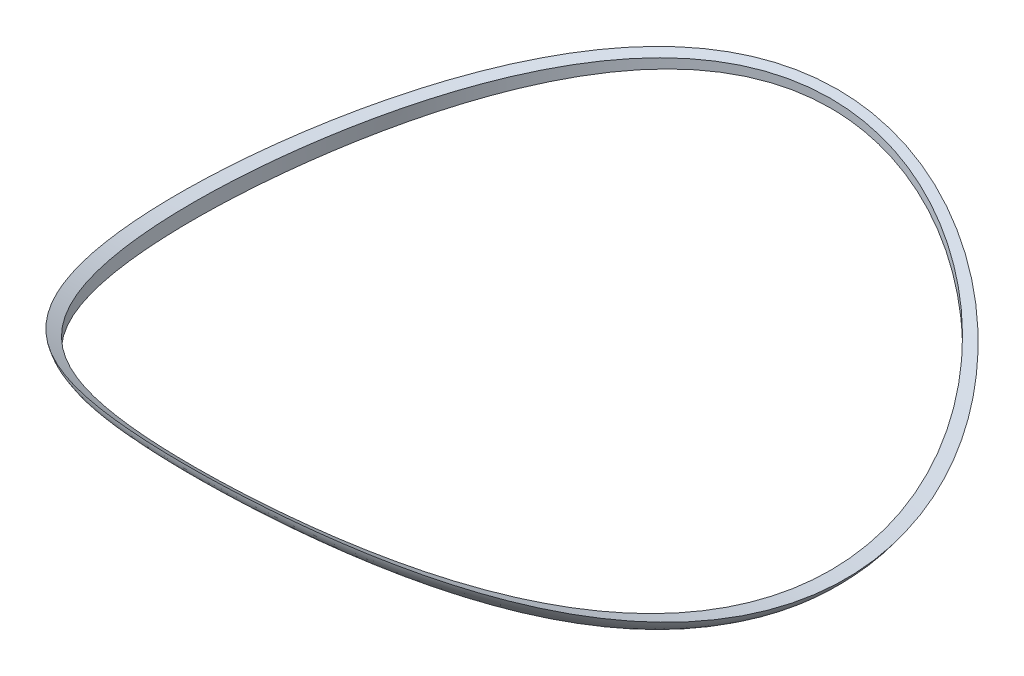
ISO-10303-21;
HEADER;
FILE_DESCRIPTION(('STEP AP214'),'2;1');
FILE_NAME('part.step','',(''),(''),'','','');
FILE_SCHEMA(('AUTOMOTIVE_DESIGN { 1 0 10303 214 1 1 1 1 }'));
ENDSEC;
DATA;
#1=APPLICATION_CONTEXT('core data for automotive mechanical design processes');
#2=APPLICATION_PROTOCOL_DEFINITION('international standard','automotive_design',2000,#1);
#3=PRODUCT_CONTEXT('',#1,'mechanical');
#4=PRODUCT('Part','Part','',(#3));
#5=PRODUCT_RELATED_PRODUCT_CATEGORY('part','',(#4));
#6=PRODUCT_DEFINITION_FORMATION('','',#4);
#7=PRODUCT_DEFINITION_CONTEXT('part definition',#1,'design');
#8=PRODUCT_DEFINITION('design','',#6,#7);
#9=PRODUCT_DEFINITION_SHAPE('','',#8);
#10=(LENGTH_UNIT() NAMED_UNIT(*) SI_UNIT(.MILLI.,.METRE.));
#11=(NAMED_UNIT(*) PLANE_ANGLE_UNIT() SI_UNIT($,.RADIAN.));
#12=(NAMED_UNIT(*) SI_UNIT($,.STERADIAN.) SOLID_ANGLE_UNIT());
#13=UNCERTAINTY_MEASURE_WITH_UNIT(LENGTH_MEASURE(1.E-05),#10,'distance_accuracy_value','');
#14=(GEOMETRIC_REPRESENTATION_CONTEXT(3) GLOBAL_UNCERTAINTY_ASSIGNED_CONTEXT((#13)) GLOBAL_UNIT_ASSIGNED_CONTEXT((#10,
#11,#12)) REPRESENTATION_CONTEXT('',''));
#15=CARTESIAN_POINT('',(0.,0.,0.));
#16=DIRECTION('',(0.,0.,1.));
#17=DIRECTION('',(1.,0.,0.));
#18=AXIS2_PLACEMENT_3D('',#15,#16,#17);
#19=CARTESIAN_POINT('',(-78.5,0.,0.));
#20=DIRECTION('',(1.,0.,0.));
#21=DIRECTION('',(0.,0.,-1.));
#22=AXIS2_PLACEMENT_3D('',#19,#20,#21);
#23=CYLINDRICAL_SURFACE('',#22,85.);
#24=CARTESIAN_POINT('',(5.16715233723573,-71.9883237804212,-45.1960312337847));
#25=CARTESIAN_POINT('',(5.55709479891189,-72.0149868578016,-45.1535621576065));
#26=CARTESIAN_POINT('',(5.94631283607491,-72.0445908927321,-45.1063263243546));
#27=CARTESIAN_POINT('',(6.72300421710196,-72.1095463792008,-45.0024119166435));
#28=CARTESIAN_POINT('',(7.11047756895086,-72.1448978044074,-44.9457333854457));
#29=CARTESIAN_POINT('',(7.88362839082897,-72.2212892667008,-44.822880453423));
#30=CARTESIAN_POINT('',(8.26930445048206,-72.2623331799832,-44.7566995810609));
#31=CARTESIAN_POINT('',(9.03831746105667,-72.349952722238,-44.6149221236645));
#32=CARTESIAN_POINT('',(9.4216542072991,-72.3965288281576,-44.5393247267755));
#33=CARTESIAN_POINT('',(10.4057870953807,-72.5233884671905,-44.3326086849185));
#34=CARTESIAN_POINT('',(11.0046416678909,-72.6076331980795,-44.1945934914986));
#35=CARTESIAN_POINT('',(12.1948089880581,-72.7885565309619,-43.8959736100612));
#36=CARTESIAN_POINT('',(12.7861212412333,-72.8852359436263,-43.735367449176));
#37=CARTESIAN_POINT('',(13.9605715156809,-73.0902420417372,-43.3918947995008));
#38=CARTESIAN_POINT('',(14.5437047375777,-73.1985752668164,-43.2090158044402));
#39=CARTESIAN_POINT('',(15.7005713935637,-73.4259278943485,-42.8215315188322));
#40=CARTESIAN_POINT('',(16.2743049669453,-73.5449471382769,-42.6169265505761));
#41=CARTESIAN_POINT('',(17.4128395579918,-73.7929377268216,-42.186066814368));
#42=CARTESIAN_POINT('',(17.9776192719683,-73.9219294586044,-41.9597674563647));
#43=CARTESIAN_POINT('',(19.096296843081,-74.1885878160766,-41.4864707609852));
#44=CARTESIAN_POINT('',(19.6501946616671,-74.3262544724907,-41.2394733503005));
#45=CARTESIAN_POINT('',(21.294379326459,-74.750845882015,-40.4679566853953));
#46=CARTESIAN_POINT('',(22.3675552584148,-75.0494498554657,-39.912762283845));
#47=CARTESIAN_POINT('',(23.9363905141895,-75.5134846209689,-39.0233881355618));
#48=CARTESIAN_POINT('',(24.4513820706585,-75.6704734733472,-38.7182620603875));
#49=CARTESIAN_POINT('',(25.4682542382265,-75.9891177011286,-38.0890839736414));
#50=CARTESIAN_POINT('',(25.9701348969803,-76.1507730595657,-37.7650320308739));
#51=CARTESIAN_POINT('',(26.9601440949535,-76.4777779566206,-37.0983462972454));
#52=CARTESIAN_POINT('',(27.4482725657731,-76.643127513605,-36.7557124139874));
#53=CARTESIAN_POINT('',(28.4104585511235,-76.9764485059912,-36.0524317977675));
#54=CARTESIAN_POINT('',(28.884516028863,-77.1444199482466,-35.6917850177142));
#55=CARTESIAN_POINT('',(29.817954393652,-77.4820310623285,-34.952823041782));
#56=CARTESIAN_POINT('',(30.2773368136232,-77.6516705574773,-34.5745097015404));
#57=CARTESIAN_POINT('',(31.1809785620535,-77.9916757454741,-33.8005497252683));
#58=CARTESIAN_POINT('',(31.625237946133,-78.1620414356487,-33.4049031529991));
#59=CARTESIAN_POINT('',(32.4982786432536,-78.5025251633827,-32.5967147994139));
#60=CARTESIAN_POINT('',(32.9270587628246,-78.6726431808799,-32.1841717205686));
#61=CARTESIAN_POINT('',(33.7687489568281,-79.0116508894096,-31.3426997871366));
#62=CARTESIAN_POINT('',(34.1816587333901,-79.1805405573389,-30.9137706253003));
#63=CARTESIAN_POINT('',(35.0442684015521,-79.5384155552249,-29.9820155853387));
#64=CARTESIAN_POINT('',(35.4916292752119,-79.7271105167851,-29.4769094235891));
#65=CARTESIAN_POINT('',(36.3642227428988,-80.1005526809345,-28.4464716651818));
#66=CARTESIAN_POINT('',(36.7894548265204,-80.2852997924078,-27.9211396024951));
#67=CARTESIAN_POINT('',(37.4100848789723,-80.5584686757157,-27.1184999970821));
#68=CARTESIAN_POINT('',(37.6141071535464,-80.648873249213,-26.8484915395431));
#69=CARTESIAN_POINT('',(38.0163154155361,-80.828207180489,-26.3036720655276));
#70=CARTESIAN_POINT('',(38.2145014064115,-80.9171365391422,-26.028861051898));
#71=CARTESIAN_POINT('',(38.6048733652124,-81.0933680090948,-25.4745021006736));
#72=CARTESIAN_POINT('',(38.7970593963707,-81.1806701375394,-25.1949542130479));
#73=CARTESIAN_POINT('',(39.1753046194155,-81.3534931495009,-24.6312012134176));
#74=CARTESIAN_POINT('',(39.3613638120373,-81.4390140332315,-24.346996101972));
#75=CARTESIAN_POINT('',(39.7272462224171,-81.6081067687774,-23.7740637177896));
#76=CARTESIAN_POINT('',(39.9070699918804,-81.6916787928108,-23.4853368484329));
#77=CARTESIAN_POINT('',(40.2604248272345,-81.856718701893,-22.9034729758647));
#78=CARTESIAN_POINT('',(40.433955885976,-81.9381865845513,-22.6103359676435));
#79=CARTESIAN_POINT('',(40.9449404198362,-82.179213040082,-21.7244436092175));
#80=CARTESIAN_POINT('',(41.272798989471,-82.3354007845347,-21.125185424));
#81=CARTESIAN_POINT('',(41.9019167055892,-82.6375612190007,-19.910430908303));
#82=CARTESIAN_POINT('',(42.2031775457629,-82.7835345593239,-19.2949356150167));
#83=CARTESIAN_POINT('',(42.7780697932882,-83.0641501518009,-18.0486779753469));
#84=CARTESIAN_POINT('',(43.0517038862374,-83.198793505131,-17.4179171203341));
#85=CARTESIAN_POINT('',(43.4732325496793,-83.4074561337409,-16.3817437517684));
#86=CARTESIAN_POINT('',(43.6297805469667,-83.4852655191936,-15.9805858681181));
#87=CARTESIAN_POINT('',(43.9316194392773,-83.6357870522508,-15.173126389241));
#88=CARTESIAN_POINT('',(44.0769109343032,-83.7084994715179,-14.7668250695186));
#89=CARTESIAN_POINT('',(44.3558511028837,-83.8486021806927,-13.949332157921));
#90=CARTESIAN_POINT('',(44.4894998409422,-83.9159925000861,-13.5381405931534));
#91=CARTESIAN_POINT('',(44.744779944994,-84.0452296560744,-12.7111994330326));
#92=CARTESIAN_POINT('',(44.8664112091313,-84.1070764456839,-12.2954497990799));
#93=CARTESIAN_POINT('',(45.2131549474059,-84.2839748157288,-11.0418873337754));
#94=CARTESIAN_POINT('',(45.4201364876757,-84.3903940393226,-10.1977049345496));
#95=CARTESIAN_POINT('',(45.6941860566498,-84.5315155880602,-8.92221423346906));
#96=CARTESIAN_POINT('',(45.7794362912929,-84.5754564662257,-8.495701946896));
#97=CARTESIAN_POINT('',(45.937742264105,-84.6570605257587,-7.63982384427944));
#98=CARTESIAN_POINT('',(46.0107980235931,-84.6947237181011,-7.21045803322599));
#99=CARTESIAN_POINT('',(46.211164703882,-84.7980854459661,-5.91865441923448));
#100=CARTESIAN_POINT('',(46.3197013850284,-84.854169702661,-5.05238829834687));
#101=CARTESIAN_POINT('',(46.4436587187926,-84.918417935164,-3.74859031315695));
#102=CARTESIAN_POINT('',(46.4785031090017,-84.9365209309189,-3.31326086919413));
#103=CARTESIAN_POINT('',(46.5352552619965,-84.9660462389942,-2.44153444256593));
#104=CARTESIAN_POINT('',(46.5571635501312,-84.977468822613,-2.00513750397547));
#105=CARTESIAN_POINT('',(46.5930211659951,-84.9961151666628,-0.994779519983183));
#106=CARTESIAN_POINT('',(46.6023189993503,-85.0008983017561,-0.420602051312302));
#107=CARTESIAN_POINT('',(46.5984305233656,-84.9988243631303,0.727675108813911));
#108=CARTESIAN_POINT('',(46.5852432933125,-84.9919668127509,1.30177479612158));
#109=CARTESIAN_POINT('',(46.5365856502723,-84.9666571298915,2.44871150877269));
#110=CARTESIAN_POINT('',(46.5011173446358,-84.9482060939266,3.02154864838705));
#111=CARTESIAN_POINT('',(46.4080730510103,-84.8998263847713,4.16495697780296));
#112=CARTESIAN_POINT('',(46.3504970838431,-84.869897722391,4.73552816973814));
#113=CARTESIAN_POINT('',(46.2475954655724,-84.8165457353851,5.58881325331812));
#114=CARTESIAN_POINT('',(46.2105379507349,-84.7973515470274,5.87281734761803));
#115=CARTESIAN_POINT('',(46.1310255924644,-84.7561748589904,6.43984618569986));
#116=CARTESIAN_POINT('',(46.0885711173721,-84.7341925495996,6.72287099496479));
#117=CARTESIAN_POINT('',(45.9531369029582,-84.6641094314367,7.57032861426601));
#118=CARTESIAN_POINT('',(45.8520850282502,-84.6118717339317,8.1331557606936));
#119=CARTESIAN_POINT('',(45.6287263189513,-84.4966903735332,9.25345466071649));
#120=CARTESIAN_POINT('',(45.5064193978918,-84.4337466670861,9.81092639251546));
#121=CARTESIAN_POINT('',(45.2406111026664,-84.2975449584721,10.9195156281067));
#122=CARTESIAN_POINT('',(45.097109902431,-84.2242870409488,11.4706331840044));
#123=CARTESIAN_POINT('',(44.793520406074,-84.0699027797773,12.5515623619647));
#124=CARTESIAN_POINT('',(44.6339553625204,-83.9890281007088,13.0815568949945));
#125=CARTESIAN_POINT('',(44.2957997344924,-83.818352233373,14.13393695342));
#126=CARTESIAN_POINT('',(44.1172091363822,-83.7285510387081,14.656322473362));
#127=CARTESIAN_POINT('',(43.5534387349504,-83.4464591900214,16.2110076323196));
#128=CARTESIAN_POINT('',(43.1401920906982,-83.2414453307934,17.2310782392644));
#129=CARTESIAN_POINT('',(42.4671878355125,-82.911830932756,18.7320950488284));
#130=CARTESIAN_POINT('',(42.2339576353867,-82.7982581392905,19.227659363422));
#131=CARTESIAN_POINT('',(41.7501360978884,-82.5643052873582,20.2086515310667));
#132=CARTESIAN_POINT('',(41.4995447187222,-82.4439252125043,20.6940793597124));
#133=CARTESIAN_POINT('',(40.9817018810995,-82.1969273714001,21.6543522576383));
#134=CARTESIAN_POINT('',(40.7144497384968,-82.0703093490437,22.1291968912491));
#135=CARTESIAN_POINT('',(40.1637929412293,-81.8114350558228,23.0678588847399));
#136=CARTESIAN_POINT('',(39.8803881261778,-81.6791787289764,23.5316761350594));
#137=CARTESIAN_POINT('',(39.2697640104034,-81.3966784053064,24.4919318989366));
#138=CARTESIAN_POINT('',(38.9409535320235,-81.2459286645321,24.9872108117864));
#139=CARTESIAN_POINT('',(38.2647494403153,-80.9392958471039,25.9632842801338));
#140=CARTESIAN_POINT('',(37.9173555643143,-80.7834126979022,26.4440786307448));
#141=CARTESIAN_POINT('',(37.2047245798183,-80.4673375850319,27.390812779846));
#142=CARTESIAN_POINT('',(36.8394869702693,-80.3071455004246,27.8567521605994));
#143=CARTESIAN_POINT('',(36.0918153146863,-79.9833050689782,28.7733763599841));
#144=CARTESIAN_POINT('',(35.7093812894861,-79.8196567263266,29.2240611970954));
#145=CARTESIAN_POINT('',(34.9276179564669,-79.4896599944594,30.1100909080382));
#146=CARTESIAN_POINT('',(34.528277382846,-79.3233098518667,30.5454251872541));
#147=CARTESIAN_POINT('',(33.7134123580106,-78.9889280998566,31.3999968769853));
#148=CARTESIAN_POINT('',(33.2978879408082,-78.8208964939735,31.8192343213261));
#149=CARTESIAN_POINT('',(32.451313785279,-78.4839784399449,32.6414228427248));
#150=CARTESIAN_POINT('',(32.0202631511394,-78.3150919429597,33.0443729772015));
#151=CARTESIAN_POINT('',(31.1430948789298,-77.9773931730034,33.8335687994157));
#152=CARTESIAN_POINT('',(30.6969770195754,-77.8085809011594,34.2198142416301));
#153=CARTESIAN_POINT('',(29.7367782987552,-77.452226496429,35.0195101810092));
#154=CARTESIAN_POINT('',(29.2208697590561,-77.2648135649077,35.4308268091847));
#155=CARTESIAN_POINT('',(28.1714010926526,-76.8925867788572,36.2315476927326));
#156=CARTESIAN_POINT('',(27.637840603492,-76.7077729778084,36.620951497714));
#157=CARTESIAN_POINT('',(26.5537230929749,-76.3420484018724,37.3773739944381));
#158=CARTESIAN_POINT('',(26.0031651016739,-76.1611378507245,37.7443914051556));
#159=CARTESIAN_POINT('',(24.8855835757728,-75.8047080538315,38.4552259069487));
#160=CARTESIAN_POINT('',(24.3185602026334,-75.629188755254,38.7990432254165));
#161=CARTESIAN_POINT('',(23.1688348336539,-75.2847755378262,39.4631787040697));
#162=CARTESIAN_POINT('',(22.5861311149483,-75.1158823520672,39.7834942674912));
#163=CARTESIAN_POINT('',(21.4058959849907,-74.7861570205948,40.3999116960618));
#164=CARTESIAN_POINT('',(20.808364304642,-74.6253250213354,40.6960131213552));
#165=CARTESIAN_POINT('',(18.9944940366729,-74.1569781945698,41.5471117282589));
#166=CARTESIAN_POINT('',(17.7566054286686,-73.8635290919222,42.0650621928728));
#167=CARTESIAN_POINT('',(16.0757324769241,-73.5045661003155,42.6861878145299));
#168=CARTESIAN_POINT('',(15.653706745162,-73.4176551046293,42.8354467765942));
#169=CARTESIAN_POINT('',(14.8045475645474,-73.2495608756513,43.1222623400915));
#170=CARTESIAN_POINT('',(14.3774143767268,-73.1683773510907,43.2598195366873));
#171=CARTESIAN_POINT('',(13.5183897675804,-73.0121301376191,43.523008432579));
#172=CARTESIAN_POINT('',(13.0864983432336,-72.9370664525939,43.6486401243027));
#173=CARTESIAN_POINT('',(12.2182909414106,-72.793421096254,43.8877808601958));
#174=CARTESIAN_POINT('',(11.7819748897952,-72.7248395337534,44.0012897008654));
#175=CARTESIAN_POINT('',(10.9053380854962,-72.5944646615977,44.2160545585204));
#176=CARTESIAN_POINT('',(10.4650173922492,-72.5326712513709,44.3173107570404));
#177=CARTESIAN_POINT('',(9.5807786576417,-72.4161664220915,44.5074293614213));
#178=CARTESIAN_POINT('',(9.13686064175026,-72.3614549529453,44.5962918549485));
#179=CARTESIAN_POINT('',(8.24641301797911,-72.2595108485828,44.7612833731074));
#180=CARTESIAN_POINT('',(7.79988755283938,-72.2122685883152,44.837428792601));
#181=CARTESIAN_POINT('',(6.90411883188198,-72.1254071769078,44.9770207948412));
#182=CARTESIAN_POINT('',(6.45487557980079,-72.0857880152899,45.0404673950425));
#183=CARTESIAN_POINT('',(5.55413922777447,-72.0143386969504,45.1546182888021));
#184=CARTESIAN_POINT('',(5.10264605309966,-71.9825088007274,45.2053221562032));
#185=CARTESIAN_POINT('',(4.19789793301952,-71.9268819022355,45.2937787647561));
#186=CARTESIAN_POINT('',(3.74464298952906,-71.9030848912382,45.3315315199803));
#187=CARTESIAN_POINT('',(2.83694833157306,-71.8636431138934,45.3940322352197));
#188=CARTESIAN_POINT('',(2.38250879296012,-71.8479971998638,45.4187820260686));
#189=CARTESIAN_POINT('',(1.47290228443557,-71.824917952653,45.4552706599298));
#190=CARTESIAN_POINT('',(1.01773532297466,-71.8174845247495,45.4670096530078));
#191=CARTESIAN_POINT('',(0.167469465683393,-71.8112646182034,45.4768324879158));
#192=CARTESIAN_POINT('',(-0.227604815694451,-71.8114637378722,45.4765182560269));
#193=CARTESIAN_POINT('',(-1.01757119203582,-71.8179950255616,45.4662031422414));
#194=CARTESIAN_POINT('',(-1.41246328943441,-71.8243271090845,45.456202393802));
#195=CARTESIAN_POINT('',(-2.20170341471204,-71.8431264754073,45.4264845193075));
#196=CARTESIAN_POINT('',(-2.59605149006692,-71.8555931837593,45.4067683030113));
#197=CARTESIAN_POINT('',(-3.38387874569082,-71.8866595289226,45.357568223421));
#198=CARTESIAN_POINT('',(-3.77735792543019,-71.9052591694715,45.3280843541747));
#199=CARTESIAN_POINT('',(-4.95598082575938,-71.9701571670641,45.2250296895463));
#200=CARTESIAN_POINT('',(-5.73944410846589,-72.0255578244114,45.1368507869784));
#201=CARTESIAN_POINT('',(-6.90910387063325,-72.12617388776,44.9757593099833));
#202=CARTESIAN_POINT('',(-7.29814063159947,-72.1626402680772,44.9172445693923));
#203=CARTESIAN_POINT('',(-8.074111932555,-72.2412343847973,44.7907315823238));
#204=CARTESIAN_POINT('',(-8.46104647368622,-72.2833621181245,44.7227333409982));
#205=CARTESIAN_POINT('',(-9.23249797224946,-72.3731628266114,44.5772654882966));
#206=CARTESIAN_POINT('',(-9.61701481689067,-72.4208360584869,44.499795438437));
#207=CARTESIAN_POINT('',(-10.3833235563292,-72.5215587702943,44.3354575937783));
#208=CARTESIAN_POINT('',(-10.7651154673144,-72.5746082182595,44.2485898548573));
#209=CARTESIAN_POINT('',(-11.525714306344,-72.6858401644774,44.065634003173));
#210=CARTESIAN_POINT('',(-11.9045213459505,-72.7440224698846,43.9695462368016));
#211=CARTESIAN_POINT('',(-12.6589325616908,-72.8652887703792,43.7682932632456));
#212=CARTESIAN_POINT('',(-13.0345366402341,-72.9283729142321,43.6631277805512));
#213=CARTESIAN_POINT('',(-13.957741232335,-73.0899761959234,43.3922874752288));
#214=CARTESIAN_POINT('',(-14.5033379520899,-73.1912314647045,43.2213770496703));
#215=CARTESIAN_POINT('',(-15.5863465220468,-73.4031596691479,42.8604705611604));
#216=CARTESIAN_POINT('',(-16.1237578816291,-73.5138331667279,42.6704733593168));
#217=CARTESIAN_POINT('',(-17.1897441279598,-73.7437488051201,42.2718868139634));
#218=CARTESIAN_POINT('',(-17.7183194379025,-73.8629905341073,42.0632983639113));
#219=CARTESIAN_POINT('',(-18.7662119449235,-74.1090940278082,41.6281718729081));
#220=CARTESIAN_POINT('',(-19.2855292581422,-74.2359556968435,41.4016340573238));
#221=CARTESIAN_POINT('',(-20.314432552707,-74.4966286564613,40.930731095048));
#222=CARTESIAN_POINT('',(-20.8240156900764,-74.6304419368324,40.6863608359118));
#223=CARTESIAN_POINT('',(-21.8327006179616,-74.9042309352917,40.1800821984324));
#224=CARTESIAN_POINT('',(-22.3318024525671,-75.04420662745,39.9181738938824));
#225=CARTESIAN_POINT('',(-23.31904412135,-75.3295017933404,39.3771463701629));
#226=CARTESIAN_POINT('',(-23.8071836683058,-75.4748214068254,39.0980267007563));
#227=CARTESIAN_POINT('',(-24.7721519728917,-75.7698946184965,38.5230778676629));
#228=CARTESIAN_POINT('',(-25.2489805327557,-75.9196482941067,38.2272484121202));
#229=CARTESIAN_POINT('',(-26.251449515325,-76.2423701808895,37.5798886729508));
#230=CARTESIAN_POINT('',(-26.775467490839,-76.4158442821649,37.2260915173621));
#231=CARTESIAN_POINT('',(-27.8077938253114,-76.7662694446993,36.4979889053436));
#232=CARTESIAN_POINT('',(-28.3161018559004,-76.943220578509,36.1236830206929));
#233=CARTESIAN_POINT('',(-29.816956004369,-77.4775106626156,34.9707378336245));
#234=CARTESIAN_POINT('',(-30.7855437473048,-77.8383226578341,34.1619988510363));
#235=CARTESIAN_POINT('',(-32.186327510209,-78.379584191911,32.8915360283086));
#236=CARTESIAN_POINT('',(-32.6447571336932,-78.5600890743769,32.4582920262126));
#237=CARTESIAN_POINT('',(-33.543801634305,-78.9199781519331,31.5731723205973));
#238=CARTESIAN_POINT('',(-33.984416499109,-79.099362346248,31.1212966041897));
#239=CARTESIAN_POINT('',(-34.8471251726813,-79.4559186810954,30.1993594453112));
#240=CARTESIAN_POINT('',(-35.2692187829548,-79.6330907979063,29.7292978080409));
#241=CARTESIAN_POINT('',(-36.0940236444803,-79.984206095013,28.7712879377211));
#242=CARTESIAN_POINT('',(-36.4967347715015,-80.1581492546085,28.2833395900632));
#243=CARTESIAN_POINT('',(-37.308529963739,-80.5132809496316,27.256670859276));
#244=CARTESIAN_POINT('',(-37.7162198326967,-80.6941695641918,26.7167432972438));
#245=CARTESIAN_POINT('',(-38.5081783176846,-81.0496971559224,25.6179639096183));
#246=CARTESIAN_POINT('',(-38.8924464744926,-81.224336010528,25.0591117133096));
#247=CARTESIAN_POINT('',(-39.6365931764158,-81.5661536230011,23.9230940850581));
#248=CARTESIAN_POINT('',(-39.9964695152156,-81.7333317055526,23.3459270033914));
#249=CARTESIAN_POINT('',(-40.6908042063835,-82.0589931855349,22.1741159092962));
#250=CARTESIAN_POINT('',(-41.0252628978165,-82.2174766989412,21.5794721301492));
#251=CARTESIAN_POINT('',(-41.6676450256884,-82.5244481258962,20.3740522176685));
#252=CARTESIAN_POINT('',(-41.975586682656,-82.6729428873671,19.7632875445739));
#253=CARTESIAN_POINT('',(-42.5642194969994,-82.9589219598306,18.5262064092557));
#254=CARTESIAN_POINT('',(-42.8449099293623,-83.0964059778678,17.8998895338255));
#255=CARTESIAN_POINT('',(-43.3777634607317,-83.3592717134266,16.6328103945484));
#256=CARTESIAN_POINT('',(-43.629928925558,-83.4846544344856,15.9920493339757));
#257=CARTESIAN_POINT('',(-44.1051714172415,-83.7222622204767,14.6974769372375));
#258=CARTESIAN_POINT('',(-44.3282515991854,-83.8344887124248,14.0436670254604));
#259=CARTESIAN_POINT('',(-44.6623513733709,-84.0034376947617,12.984087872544));
#260=CARTESIAN_POINT('',(-44.7829114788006,-84.0646168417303,12.5820069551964));
#261=CARTESIAN_POINT('',(-45.012896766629,-84.1816005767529,11.7739024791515));
#262=CARTESIAN_POINT('',(-45.1223223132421,-84.2374053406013,11.3678790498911));
#263=CARTESIAN_POINT('',(-45.3298499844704,-84.3434608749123,10.5522383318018));
#264=CARTESIAN_POINT('',(-45.4279523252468,-84.3937117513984,10.1426211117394));
#265=CARTESIAN_POINT('',(-45.6127089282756,-84.4884972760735,9.32015037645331));
#266=CARTESIAN_POINT('',(-45.6993630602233,-84.5330318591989,8.90729682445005));
#267=CARTESIAN_POINT('',(-45.8609051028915,-84.6162385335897,8.0787069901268));
#268=CARTESIAN_POINT('',(-45.9357932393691,-84.6549107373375,7.66297076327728));
#269=CARTESIAN_POINT('',(-46.0737054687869,-84.7262611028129,6.82904862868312));
#270=CARTESIAN_POINT('',(-46.1367295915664,-84.7589392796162,6.41086272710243));
#271=CARTESIAN_POINT('',(-46.3078688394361,-84.847765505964,5.15378903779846));
#272=CARTESIAN_POINT('',(-46.3981849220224,-84.894774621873,4.3116971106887));
#273=CARTESIAN_POINT('',(-46.49743673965,-84.9464888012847,3.04514453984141));
#274=CARTESIAN_POINT('',(-46.5244843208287,-84.960593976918,2.62235829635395));
#275=CARTESIAN_POINT('',(-46.5665087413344,-84.9824976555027,1.77600576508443));
#276=CARTESIAN_POINT('',(-46.5814857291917,-84.9902962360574,1.35243948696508));
#277=CARTESIAN_POINT('',(-46.5992546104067,-84.9995557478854,0.505037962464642));
#278=CARTESIAN_POINT('',(-46.6020480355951,-85.0010174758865,0.0812027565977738));
#279=CARTESIAN_POINT('',(-46.5953969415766,-84.9976018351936,-0.766354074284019));
#280=CARTESIAN_POINT('',(-46.5859519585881,-84.9927242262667,-1.19007569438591));
#281=CARTESIAN_POINT('',(-46.5498747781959,-84.9739913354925,-2.17668476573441));
#282=CARTESIAN_POINT('',(-46.5186005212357,-84.9577052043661,-2.73936856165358));
#283=CARTESIAN_POINT('',(-46.4557894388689,-84.9249635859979,-3.58184282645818));
#284=CARTESIAN_POINT('',(-46.4322012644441,-84.9126636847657,-3.86241963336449));
#285=CARTESIAN_POINT('',(-46.3797616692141,-84.8853116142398,-4.42296414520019));
#286=CARTESIAN_POINT('',(-46.350909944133,-84.8702592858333,-4.70293181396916));
#287=CARTESIAN_POINT('',(-46.2563900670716,-84.8210131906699,-5.54159591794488));
#288=CARTESIAN_POINT('',(-46.1827478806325,-84.7827254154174,-6.09917911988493));
#289=CARTESIAN_POINT('',(-46.0145246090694,-84.6954655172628,-7.21032117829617));
#290=CARTESIAN_POINT('',(-45.9199432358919,-84.6464932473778,-7.76387997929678));
#291=CARTESIAN_POINT('',(-45.7100961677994,-84.5381555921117,-8.86605077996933));
#292=CARTESIAN_POINT('',(-45.5948301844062,-84.4787900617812,-9.41466271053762));
#293=CARTESIAN_POINT('',(-45.3437568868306,-84.3500230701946,-10.5059762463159));
#294=CARTESIAN_POINT('',(-45.2079493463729,-84.280621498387,-11.0486777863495));
#295=CARTESIAN_POINT('',(-44.9164933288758,-84.1321728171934,-12.1274027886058));
#296=CARTESIAN_POINT('',(-44.7608443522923,-84.0531254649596,-12.6634260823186));
#297=CARTESIAN_POINT('',(-44.4298935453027,-83.8858427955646,-13.7279160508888));
#298=CARTESIAN_POINT('',(-44.2545917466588,-83.7976074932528,-14.2563827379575));
#299=CARTESIAN_POINT('',(-43.883915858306,-83.612009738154,-15.3074476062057));
#300=CARTESIAN_POINT('',(-43.6884519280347,-83.5146066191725,-15.8300068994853));
#301=CARTESIAN_POINT('',(-43.2787532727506,-83.3115467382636,-16.866086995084));
#302=CARTESIAN_POINT('',(-43.0645182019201,-83.2058898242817,-17.3796076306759));
#303=CARTESIAN_POINT('',(-42.618165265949,-82.9868459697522,-18.3971246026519));
#304=CARTESIAN_POINT('',(-42.3860476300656,-82.8734591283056,-18.9011210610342));
#305=CARTESIAN_POINT('',(-41.9042607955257,-82.6395432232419,-19.8989569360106));
#306=CARTESIAN_POINT('',(-41.6545918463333,-82.5190142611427,-20.39279649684));
#307=CARTESIAN_POINT('',(-41.1378496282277,-82.2714235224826,-21.369765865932));
#308=CARTESIAN_POINT('',(-40.8707722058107,-82.1443601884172,-21.852893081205));
#309=CARTESIAN_POINT('',(-40.3196610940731,-81.884370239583,-22.807778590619));
#310=CARTESIAN_POINT('',(-40.0356273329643,-81.7514435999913,-23.2795368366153));
#311=CARTESIAN_POINT('',(-39.5973558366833,-81.5481347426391,-23.978335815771));
#312=CARTESIAN_POINT('',(-39.4492242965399,-81.4797100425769,-24.2098019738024));
#313=CARTESIAN_POINT('',(-39.1489742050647,-81.3416283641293,-24.6697618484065));
#314=CARTESIAN_POINT('',(-38.9968556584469,-81.2719713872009,-24.8982555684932));
#315=CARTESIAN_POINT('',(-38.5345481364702,-81.0612855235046,-25.579166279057));
#316=CARTESIAN_POINT('',(-38.2183988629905,-80.9185377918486,-26.0270262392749));
#317=CARTESIAN_POINT('',(-37.5342017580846,-80.6128861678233,-26.9597816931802));
#318=CARTESIAN_POINT('',(-37.1643161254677,-80.4495210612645,-27.4431770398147));
#319=CARTESIAN_POINT('',(-36.4062598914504,-80.1188634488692,-28.394031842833));
#320=CARTESIAN_POINT('',(-36.0180889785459,-79.9515708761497,-28.8614910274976));
#321=CARTESIAN_POINT('',(-35.223930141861,-79.6140185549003,-29.7799846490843));
#322=CARTESIAN_POINT('',(-34.8179407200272,-79.4437585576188,-30.2310176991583));
#323=CARTESIAN_POINT('',(-33.9887745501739,-79.1012447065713,-31.1162066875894));
#324=CARTESIAN_POINT('',(-33.5655977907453,-78.928990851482,-31.5503626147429));
#325=CARTESIAN_POINT('',(-32.7024547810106,-78.5832843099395,-32.4018318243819));
#326=CARTESIAN_POINT('',(-32.2624767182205,-78.4098308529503,-32.8191328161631));
#327=CARTESIAN_POINT('',(-31.3666247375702,-78.0627972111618,-33.636240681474));
#328=CARTESIAN_POINT('',(-30.9107509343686,-77.8892170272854,-34.0360476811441));
#329=CARTESIAN_POINT('',(-29.9833886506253,-77.5430049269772,-34.8175969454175));
#330=CARTESIAN_POINT('',(-29.5118999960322,-77.3703730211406,-35.1993390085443));
#331=CARTESIAN_POINT('',(-28.5538639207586,-77.0271124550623,-35.9442937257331));
#332=CARTESIAN_POINT('',(-28.0673162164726,-76.8564838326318,-36.3075060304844));
#333=CARTESIAN_POINT('',(-26.4827829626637,-76.3137579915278,-37.4427545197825));
#334=CARTESIAN_POINT('',(-25.3562981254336,-75.9473222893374,-38.1785308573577));
#335=CARTESIAN_POINT('',(-23.6177733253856,-75.4174884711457,-39.2090809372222));
#336=CARTESIAN_POINT('',(-23.0300232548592,-75.2441514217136,-39.540464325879));
#337=CARTESIAN_POINT('',(-21.8390413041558,-74.9053181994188,-40.1786473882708));
#338=CARTESIAN_POINT('',(-21.23580945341,-74.7398220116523,-40.4854471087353));
#339=CARTESIAN_POINT('',(-20.0146678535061,-74.4180714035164,-41.0738738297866));
#340=CARTESIAN_POINT('',(-19.3967559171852,-74.2618183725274,-41.355497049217));
#341=CARTESIAN_POINT('',(-18.1470061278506,-73.9601970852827,-41.8925307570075));
#342=CARTESIAN_POINT('',(-17.5151680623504,-73.8148289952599,-42.1479408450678));
#343=CARTESIAN_POINT('',(-16.2386824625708,-73.5364160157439,-42.6318361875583));
#344=CARTESIAN_POINT('',(-15.5940363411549,-73.4033697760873,-42.8603243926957));
#345=CARTESIAN_POINT('',(-14.2931017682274,-73.1508326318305,-43.2899266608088));
#346=CARTESIAN_POINT('',(-13.6368143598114,-73.0313405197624,-43.4910431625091));
#347=CARTESIAN_POINT('',(-12.5536488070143,-72.8479516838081,-43.7972056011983));
#348=CARTESIAN_POINT('',(-12.1298732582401,-72.7796065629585,-43.9106444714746));
#349=CARTESIAN_POINT('',(-11.2784307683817,-72.6492832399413,-44.1259275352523));
#350=CARTESIAN_POINT('',(-10.8507640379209,-72.5873046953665,-44.227772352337));
#351=CARTESIAN_POINT('',(-9.99186589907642,-72.4699747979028,-44.4197638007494));
#352=CARTESIAN_POINT('',(-9.56063413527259,-72.4146241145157,-44.509909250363));
#353=CARTESIAN_POINT('',(-8.69506386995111,-72.3107319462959,-44.6784942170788));
#354=CARTESIAN_POINT('',(-8.260725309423,-72.2621905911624,-44.7569335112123));
#355=CARTESIAN_POINT('',(-7.38926781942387,-72.1721513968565,-44.9019804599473));
#356=CARTESIAN_POINT('',(-6.95214840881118,-72.1306548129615,-44.9685860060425));
#357=CARTESIAN_POINT('',(-6.07560336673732,-72.0550171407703,-45.0896840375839));
#358=CARTESIAN_POINT('',(-5.63617775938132,-72.0208759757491,-45.1441766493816));
#359=CARTESIAN_POINT('',(-4.75678320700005,-71.9602393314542,-45.2407691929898));
#360=CARTESIAN_POINT('',(-4.3168198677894,-71.9337211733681,-45.2829058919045));
#361=CARTESIAN_POINT('',(-3.43549384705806,-71.8883534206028,-45.354894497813));
#362=CARTESIAN_POINT('',(-2.99413116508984,-71.8695038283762,-45.3847464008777));
#363=CARTESIAN_POINT('',(-2.11058103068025,-71.839547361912,-45.4321496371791));
#364=CARTESIAN_POINT('',(-1.66839377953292,-71.8284387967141,-45.4497036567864));
#365=CARTESIAN_POINT('',(-0.78356559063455,-71.8139817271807,-45.4725434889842));
#366=CARTESIAN_POINT('',(-0.340924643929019,-71.8106333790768,-45.4778290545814));
#367=CARTESIAN_POINT('',(0.543933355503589,-71.8117731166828,-45.4760293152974));
#368=CARTESIAN_POINT('',(0.986150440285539,-71.8162543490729,-45.4689548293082));
#369=CARTESIAN_POINT('',(1.8700357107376,-71.8330372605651,-45.4424362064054));
#370=CARTESIAN_POINT('',(2.31170394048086,-71.8453382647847,-45.4229931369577));
#371=CARTESIAN_POINT('',(2.95464218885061,-71.8688861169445,-45.3857179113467));
#372=CARTESIAN_POINT('',(3.15631982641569,-71.8770834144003,-45.3727359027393));
#373=CARTESIAN_POINT('',(3.55939604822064,-71.8950718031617,-45.3442271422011));
#374=CARTESIAN_POINT('',(3.76079466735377,-71.9048626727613,-45.3287007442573));
#375=CARTESIAN_POINT('',(4.36438957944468,-71.9365957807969,-45.2783367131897));
#376=CARTESIAN_POINT('',(4.7661540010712,-71.9609047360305,-45.2397044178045));
#377=CARTESIAN_POINT('',(5.16715233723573,-71.9883237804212,-45.1960312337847));
#378=B_SPLINE_CURVE_WITH_KNOTS('',3,(#24,#25,#26,#27,#28,#29,#30,#31,#32,#33,#34,#35,#36,#37,
#38,#39,#40,#41,#42,#43,#44,#45,#46,#47,#48,#49,#50,#51,#52,#53,#54,#55,#56,#57,#58,#59,#60,#61,
#62,#63,#64,#65,#66,#67,#68,#69,#70,#71,#72,#73,#74,#75,#76,#77,#78,#79,#80,#81,#82,#83,#84,#85,
#86,#87,#88,#89,#90,#91,#92,#93,#94,#95,#96,#97,#98,#99,#100,#101,#102,#103,#104,#105,#106,#107,
#108,#109,#110,#111,#112,#113,#114,#115,#116,#117,#118,#119,#120,#121,#122,#123,#124,#125,#126,
#127,#128,#129,#130,#131,#132,#133,#134,#135,#136,#137,#138,#139,#140,#141,#142,#143,#144,#145,
#146,#147,#148,#149,#150,#151,#152,#153,#154,#155,#156,#157,#158,#159,#160,#161,#162,#163,#164,
#165,#166,#167,#168,#169,#170,#171,#172,#173,#174,#175,#176,#177,#178,#179,#180,#181,#182,#183,
#184,#185,#186,#187,#188,#189,#190,#191,#192,#193,#194,#195,#196,#197,#198,#199,#200,#201,#202,
#203,#204,#205,#206,#207,#208,#209,#210,#211,#212,#213,#214,#215,#216,#217,#218,#219,#220,#221,
#222,#223,#224,#225,#226,#227,#228,#229,#230,#231,#232,#233,#234,#235,#236,#237,#238,#239,#240,
#241,#242,#243,#244,#245,#246,#247,#248,#249,#250,#251,#252,#253,#254,#255,#256,#257,#258,#259,
#260,#261,#262,#263,#264,#265,#266,#267,#268,#269,#270,#271,#272,#273,#274,#275,#276,#277,#278,
#279,#280,#281,#282,#283,#284,#285,#286,#287,#288,#289,#290,#291,#292,#293,#294,#295,#296,#297,
#298,#299,#300,#301,#302,#303,#304,#305,#306,#307,#308,#309,#310,#311,#312,#313,#314,#315,#316,
#317,#318,#319,#320,#321,#322,#323,#324,#325,#326,#327,#328,#329,#330,#331,#332,#333,#334,#335,
#336,#337,#338,#339,#340,#341,#342,#343,#344,#345,#346,#347,#348,#349,#350,#351,#352,#353,#354,
#355,#356,#357,#358,#359,#360,#361,#362,#363,#364,#365,#366,#367,#368,#369,#370,#371,#372,#373,
#374,#375,#376,#377),.UNSPECIFIED.,.T.,.F.,(4,2,2,2,2,2,2,2,2,2,2,2,2,2,2,2,2,2,2,2,2,2,2,2,2,2,
2,2,2,2,2,2,2,2,2,2,2,2,2,2,2,2,2,2,2,2,2,2,2,2,2,2,2,2,2,2,2,2,2,2,2,2,2,2,2,2,2,2,2,2,2,2,2,2,
2,2,2,2,2,2,2,2,2,2,2,2,2,2,2,2,2,2,2,2,2,2,2,2,2,2,2,2,2,2,2,2,2,2,2,2,2,2,2,2,2,2,2,2,2,2,2,2,
2,2,2,2,2,2,2,2,2,2,2,2,2,2,2,2,2,2,2,2,2,2,2,2,2,2,2,2,2,2,2,2,2,2,2,2,2,2,2,2,2,2,2,2,2,2,2,2,
2,2,2,2,2,2,4),(0.,1.17941368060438,2.35882195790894,3.53903731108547,4.71935448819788,
6.57961991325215,8.44000667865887,10.3014429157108,12.1628515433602,14.0281716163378,
15.8934982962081,19.6228519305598,21.4790525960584,23.3352465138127,25.1914496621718,
27.0476576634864,28.9036711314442,30.7596777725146,32.6158272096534,34.4720114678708,
36.5732319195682,38.6745008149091,39.7252994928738,40.7760975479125,41.8268845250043,
42.8776713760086,43.9283650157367,44.9790598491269,47.0803707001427,49.1815476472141,
51.2825201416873,52.5951235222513,53.9076568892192,55.2201829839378,56.5327202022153,
59.1576150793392,60.4689226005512,61.7802278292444,64.4024619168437,65.7135608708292,
67.0246065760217,68.7468563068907,70.4691765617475,72.1913339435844,73.9134897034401,
74.7745940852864,75.6356397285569,77.3576973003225,79.0797618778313,80.8018123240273,
82.4794492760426,84.157087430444,87.5116031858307,89.1893743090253,90.8671494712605,
92.5449935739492,94.2228543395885,96.0622851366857,97.9017419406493,99.7412504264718,
101.580756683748,103.421508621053,105.262256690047,107.103111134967,108.94399262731,
111.001115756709,113.058281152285,115.115564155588,117.172826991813,119.230316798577,
121.287843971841,125.401916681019,126.769806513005,128.137626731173,129.505447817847,
130.873291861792,132.241115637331,133.608929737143,134.974966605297,136.341001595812,
137.707082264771,139.07316144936,140.439048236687,141.804919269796,142.989979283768,
144.175022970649,145.359955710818,146.544889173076,148.914353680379,150.099532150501,
151.284709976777,152.469942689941,153.655168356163,154.840349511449,156.025566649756,
157.766991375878,159.508520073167,161.24996512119,162.991388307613,164.7333127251,
166.475229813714,168.217192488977,169.959185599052,171.925526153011,173.89190777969,
177.824258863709,179.792116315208,181.759975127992,183.72785502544,185.695747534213,
187.796042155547,189.896377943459,191.996903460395,194.09740095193,196.196443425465,
198.295541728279,200.394465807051,202.493162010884,203.765588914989,205.037974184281,
206.310335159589,207.58271061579,208.855061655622,210.127409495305,212.669995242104,
213.941485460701,215.212960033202,216.484274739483,217.755637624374,219.446415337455,
220.29186839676,221.137370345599,222.827996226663,224.518645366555,226.209318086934,
227.900009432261,229.590743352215,231.281474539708,232.980094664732,234.678746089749,
236.377375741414,238.075981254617,239.774993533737,241.47401300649,242.32356936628,
243.173124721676,244.872186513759,246.762350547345,248.652546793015,250.542902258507,
252.433258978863,254.324970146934,256.216667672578,258.108386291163,260.000140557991,
264.177523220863,266.26695793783,268.356388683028,270.446132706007,272.535908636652,
274.625455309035,276.714815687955,278.046586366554,279.378285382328,280.710118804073,
282.04197759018,283.374073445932,284.706155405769,286.034232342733,287.362309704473,
288.690096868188,290.017910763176,291.344562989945,292.671100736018,293.277865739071,
293.884546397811,295.097399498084),.UNSPECIFIED.);
#379=CARTESIAN_POINT('',(5.16715233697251,-71.9883237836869,-45.1960312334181));
#380=VERTEX_POINT('',#379);
#381=EDGE_CURVE('E56',#380,#380,#378,.T.);
#382=ORIENTED_EDGE('',*,*,#381,.F.);
#383=EDGE_LOOP('',(#382));
#384=FACE_BOUND('',#383,.T.);
#385=CARTESIAN_POINT('',(0.,-72.4206462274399,-44.5));
#386=CARTESIAN_POINT('',(-0.575579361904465,-72.4206469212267,-44.4999993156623));
#387=CARTESIAN_POINT('',(-1.15116463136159,-72.4275162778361,-44.4888269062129));
#388=CARTESIAN_POINT('',(-2.30116177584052,-72.4549138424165,-44.4441896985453));
#389=CARTESIAN_POINT('',(-2.875573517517,-72.4754435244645,-44.4107224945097));
#390=CARTESIAN_POINT('',(-4.59560193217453,-72.5572857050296,-44.2769952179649));
#391=CARTESIAN_POINT('',(-5.73790636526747,-72.6388512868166,-44.1434095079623));
#392=CARTESIAN_POINT('',(-8.0057334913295,-72.8530303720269,-43.7890211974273));
#393=CARTESIAN_POINT('',(-9.13122541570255,-72.9857278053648,-43.5680751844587));
#394=CARTESIAN_POINT('',(-11.3556683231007,-73.2972610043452,-43.041896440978));
#395=CARTESIAN_POINT('',(-12.4546213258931,-73.4760932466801,-42.7366701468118));
#396=CARTESIAN_POINT('',(-14.6129892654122,-73.8726614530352,-42.0474350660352));
#397=CARTESIAN_POINT('',(-15.6725959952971,-74.0901666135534,-41.6638917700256));
#398=CARTESIAN_POINT('',(-17.7534673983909,-74.5580816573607,-40.8206418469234));
#399=CARTESIAN_POINT('',(-18.7747314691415,-74.8084920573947,-40.3609340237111));
#400=CARTESIAN_POINT('',(-20.7743935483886,-75.335216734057,-39.3690271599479));
#401=CARTESIAN_POINT('',(-21.7527915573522,-75.611531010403,-38.8368281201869));
#402=CARTESIAN_POINT('',(-23.6629640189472,-76.1830369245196,-37.7034171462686));
#403=CARTESIAN_POINT('',(-24.5947361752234,-76.4782294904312,-37.1022018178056));
#404=CARTESIAN_POINT('',(-26.4908186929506,-77.1079933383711,-35.7763012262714));
#405=CARTESIAN_POINT('',(-27.4503803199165,-77.4437042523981,-35.0453595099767));
#406=CARTESIAN_POINT('',(-29.3059463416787,-78.1206895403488,-33.5091398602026));
#407=CARTESIAN_POINT('',(-30.201947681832,-78.4619641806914,-32.7038583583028));
#408=CARTESIAN_POINT('',(-31.926747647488,-79.1418897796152,-31.022315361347));
#409=CARTESIAN_POINT('',(-32.7555117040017,-79.4805393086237,-30.1460178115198));
#410=CARTESIAN_POINT('',(-34.3410490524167,-80.1469911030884,-28.3266384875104));
#411=CARTESIAN_POINT('',(-35.0978199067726,-80.4747930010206,-27.3835544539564));
#412=CARTESIAN_POINT('',(-36.5893084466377,-81.1359800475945,-25.3607724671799));
#413=CARTESIAN_POINT('',(-37.3180006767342,-81.4679031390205,-24.2761380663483));
#414=CARTESIAN_POINT('',(-38.6806473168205,-82.1010257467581,-22.0402251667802));
#415=CARTESIAN_POINT('',(-39.3145956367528,-82.4022232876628,-20.8889423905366));
#416=CARTESIAN_POINT('',(-40.4810372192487,-82.9650740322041,-18.5275132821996));
#417=CARTESIAN_POINT('',(-41.0135841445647,-83.2267481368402,-17.3173985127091));
#418=CARTESIAN_POINT('',(-41.9712829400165,-83.7028423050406,-14.8464295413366));
#419=CARTESIAN_POINT('',(-42.3964475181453,-83.9172679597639,-13.5855813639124));
#420=CARTESIAN_POINT('',(-43.1053442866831,-84.2777253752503,-11.12178670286));
#421=CARTESIAN_POINT('',(-43.3974271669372,-84.4277433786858,-9.9218237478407));
#422=CARTESIAN_POINT('',(-43.8814110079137,-84.6775362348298,-7.49668384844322));
#423=CARTESIAN_POINT('',(-44.0733166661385,-84.7773134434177,-6.2715080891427));
#424=CARTESIAN_POINT('',(-44.3541941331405,-84.9236726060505,-3.80695083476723));
#425=CARTESIAN_POINT('',(-44.4432241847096,-84.9702846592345,-2.56757777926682));
#426=CARTESIAN_POINT('',(-44.5172406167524,-85.009020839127,-0.0849120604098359));
#427=CARTESIAN_POINT('',(-44.5022341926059,-85.0011487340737,1.1583803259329));
#428=CARTESIAN_POINT('',(-44.3748188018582,-84.9345169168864,3.51958298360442));
#429=CARTESIAN_POINT('',(-44.2718239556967,-84.8806758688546,4.63815562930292));
#430=CARTESIAN_POINT('',(-43.9821307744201,-84.7299385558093,6.86138673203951));
#431=CARTESIAN_POINT('',(-43.7954389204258,-84.6330456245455,7.96604625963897));
#432=CARTESIAN_POINT('',(-43.3404528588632,-84.3985006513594,10.1540079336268));
#433=CARTESIAN_POINT('',(-43.0721559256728,-84.2608472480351,11.2373093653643));
#434=CARTESIAN_POINT('',(-42.4567789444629,-83.9479477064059,13.3757217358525));
#435=CARTESIAN_POINT('',(-42.1096959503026,-83.7727001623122,14.4308316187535));
#436=CARTESIAN_POINT('',(-41.335249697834,-83.3860834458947,16.5197942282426));
#437=CARTESIAN_POINT('',(-40.9069346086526,-83.1742890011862,17.5532146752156));
#438=CARTESIAN_POINT('',(-39.9767042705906,-82.7207472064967,19.579479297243));
#439=CARTESIAN_POINT('',(-39.4747892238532,-82.4789999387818,20.5723235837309));
#440=CARTESIAN_POINT('',(-38.401071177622,-81.9705352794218,22.5130610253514));
#441=CARTESIAN_POINT('',(-37.8292514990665,-81.703811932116,23.4609433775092));
#442=CARTESIAN_POINT('',(-36.6195880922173,-81.1508156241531,25.3075944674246));
#443=CARTESIAN_POINT('',(-35.9817405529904,-80.8645415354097,26.2063603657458));
#444=CARTESIAN_POINT('',(-34.5760261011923,-80.2484459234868,28.0395047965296));
#445=CARTESIAN_POINT('',(-33.8015339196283,-79.917146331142,28.9683125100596));
#446=CARTESIAN_POINT('',(-32.1814102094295,-79.2455029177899,30.7581563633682));
#447=CARTESIAN_POINT('',(-31.3357744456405,-78.9051585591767,31.6191884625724));
#448=CARTESIAN_POINT('',(-29.5768656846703,-78.2232912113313,33.2703351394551));
#449=CARTESIAN_POINT('',(-28.6635363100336,-77.8817674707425,34.0603893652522));
#450=CARTESIAN_POINT('',(-26.7739379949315,-77.2063157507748,35.5649396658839));
#451=CARTESIAN_POINT('',(-25.7976667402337,-76.8723880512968,36.2794329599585));
#452=CARTESIAN_POINT('',(-23.7112263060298,-76.1966339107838,37.6791882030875));
#453=CARTESIAN_POINT('',(-22.59650137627,-75.8560763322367,38.3582940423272));
#454=CARTESIAN_POINT('',(-20.3046853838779,-75.2052086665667,39.6191910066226));
#455=CARTESIAN_POINT('',(-19.1275899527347,-74.8949007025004,40.2009753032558));
#456=CARTESIAN_POINT('',(-16.71887055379,-74.3162541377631,41.2608640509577));
#457=CARTESIAN_POINT('',(-15.4872965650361,-74.0478780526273,41.7390612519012));
#458=CARTESIAN_POINT('',(-12.977121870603,-73.5638529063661,42.5863612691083));
#459=CARTESIAN_POINT('',(-11.6985282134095,-73.3481959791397,42.9554803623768));
#460=CARTESIAN_POINT('',(-9.20968271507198,-72.9943560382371,43.5538157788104));
#461=CARTESIAN_POINT('',(-8.00226049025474,-72.8513197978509,43.7919288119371));
#462=CARTESIAN_POINT('',(-5.56636086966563,-72.6241334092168,44.1676784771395));
#463=CARTESIAN_POINT('',(-4.33788474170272,-72.5399797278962,44.3053211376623));
#464=CARTESIAN_POINT('',(-1.87196337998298,-72.4343704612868,44.4777729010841));
#465=CARTESIAN_POINT('',(-0.634525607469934,-72.4128676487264,44.5126594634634));
#466=CARTESIAN_POINT('',(1.83836475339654,-72.4334275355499,44.4791984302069));
#467=CARTESIAN_POINT('',(3.07381750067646,-72.4754848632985,44.4108595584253));
#468=CARTESIAN_POINT('',(5.37648341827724,-72.6120205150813,44.1872007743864));
#469=CARTESIAN_POINT('',(6.445325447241,-72.6992458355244,44.0438927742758));
#470=CARTESIAN_POINT('',(8.56530343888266,-72.9177826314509,43.6811379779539));
#471=CARTESIAN_POINT('',(9.61644119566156,-73.0490896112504,43.4616989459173));
#472=CARTESIAN_POINT('',(11.6949530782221,-73.3516464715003,42.9490901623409));
#473=CARTESIAN_POINT('',(12.7223203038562,-73.522907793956,42.6558992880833));
#474=CARTESIAN_POINT('',(14.7475728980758,-73.9002757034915,41.9987223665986));
#475=CARTESIAN_POINT('',(15.7454563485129,-74.1063845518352,41.6347317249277));
#476=CARTESIAN_POINT('',(17.7513645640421,-74.5577844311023,40.821106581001));
#477=CARTESIAN_POINT('',(18.7578180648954,-74.8044230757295,40.3683506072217));
#478=CARTESIAN_POINT('',(20.7291428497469,-75.3229231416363,39.3924161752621));
#479=CARTESIAN_POINT('',(21.6940136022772,-75.5947848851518,38.8692368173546));
#480=CARTESIAN_POINT('',(23.5789269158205,-76.1571150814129,37.7555689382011));
#481=CARTESIAN_POINT('',(24.4989513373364,-76.4475909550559,37.1650534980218));
#482=CARTESIAN_POINT('',(26.2905781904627,-77.0404421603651,35.9199907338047));
#483=CARTESIAN_POINT('',(27.1621772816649,-77.3428183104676,35.2654390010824));
#484=CARTESIAN_POINT('',(28.973151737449,-77.9960460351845,33.7986495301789));
#485=CARTESIAN_POINT('',(29.9047773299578,-78.3477256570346,32.9771878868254));
#486=CARTESIAN_POINT('',(31.696619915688,-79.0490091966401,31.2588445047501));
#487=CARTESIAN_POINT('',(32.5568309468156,-79.3986129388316,30.3619564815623));
#488=CARTESIAN_POINT('',(34.2015141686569,-80.087049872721,28.4965463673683));
#489=CARTESIAN_POINT('',(34.9859519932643,-80.4258781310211,27.5279921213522));
#490=CARTESIAN_POINT('',(36.4736200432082,-81.0840919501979,25.5241479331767));
#491=CARTESIAN_POINT('',(37.1768505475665,-81.4034775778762,24.4888582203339));
#492=CARTESIAN_POINT('',(38.5211222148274,-82.025964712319,22.3173276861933));
#493=CARTESIAN_POINT('',(39.1589136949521,-82.328031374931,21.1787719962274));
#494=CARTESIAN_POINT('',(40.3352261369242,-82.8939958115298,18.8422441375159));
#495=CARTESIAN_POINT('',(40.8737428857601,-83.157891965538,17.6442694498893));
#496=CARTESIAN_POINT('',(41.8448894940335,-83.639506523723,15.1982008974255));
#497=CARTESIAN_POINT('',(42.277601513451,-83.8572607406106,13.9501468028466));
#498=CARTESIAN_POINT('',(43.0318831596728,-84.2400568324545,11.4130514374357));
#499=CARTESIAN_POINT('',(43.3534675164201,-84.405105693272,10.1240156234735));
#500=CARTESIAN_POINT('',(43.8551970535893,-84.6639649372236,7.64295881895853));
#501=CARTESIAN_POINT('',(44.0460325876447,-84.7631307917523,6.45364923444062));
#502=CARTESIAN_POINT('',(44.3307453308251,-84.9114249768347,4.06039493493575));
#503=CARTESIAN_POINT('',(44.4246289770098,-84.9605566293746,2.85645119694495));
#504=CARTESIAN_POINT('',(44.5141402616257,-85.0073952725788,0.444355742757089));
#505=CARTESIAN_POINT('',(44.5098030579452,-85.005120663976,-0.763794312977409));
#506=CARTESIAN_POINT('',(44.4030171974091,-84.9492544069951,-3.17452947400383));
#507=CARTESIAN_POINT('',(44.3005721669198,-84.895664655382,-4.37711478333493));
#508=CARTESIAN_POINT('',(44.0105612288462,-84.7447083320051,-6.67513247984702));
#509=CARTESIAN_POINT('',(43.8301175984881,-84.6510099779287,-7.77171583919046));
#510=CARTESIAN_POINT('',(43.3888307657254,-84.4233670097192,-9.94423872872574));
#511=CARTESIAN_POINT('',(43.1279927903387,-84.2894250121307,-11.0201795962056));
#512=CARTESIAN_POINT('',(42.5286083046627,-83.9843201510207,-13.1448093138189));
#513=CARTESIAN_POINT('',(42.1900565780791,-83.8131547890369,-14.1934963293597));
#514=CARTESIAN_POINT('',(41.4384597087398,-83.4373421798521,-16.2576327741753));
#515=CARTESIAN_POINT('',(41.0254110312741,-83.2326933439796,-17.2730806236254));
#516=CARTESIAN_POINT('',(40.1106416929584,-82.7855550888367,-19.3048198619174));
#517=CARTESIAN_POINT('',(39.6060679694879,-82.5418922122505,-20.3195673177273));
#518=CARTESIAN_POINT('',(38.5242934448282,-82.0283158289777,-22.3025704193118));
#519=CARTESIAN_POINT('',(37.9470915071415,-81.7584019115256,-23.2708253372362));
#520=CARTESIAN_POINT('',(36.7238426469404,-81.1978756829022,-25.1569723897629));
#521=CARTESIAN_POINT('',(36.0777724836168,-80.907256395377,-26.0748473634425));
#522=CARTESIAN_POINT('',(34.7207935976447,-80.3113435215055,-27.856247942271));
#523=CARTESIAN_POINT('',(34.0098812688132,-80.0060491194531,-28.7197705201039));
#524=CARTESIAN_POINT('',(32.447001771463,-79.3536448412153,-30.4790217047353));
#525=CARTESIAN_POINT('',(31.5880854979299,-79.0055654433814,-31.3682489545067));
#526=CARTESIAN_POINT('',(30.2470591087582,-78.4822610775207,-32.6457776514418));
#527=CARTESIAN_POINT('',(29.7912388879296,-78.3076156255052,-33.0622642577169));
#528=CARTESIAN_POINT('',(28.8623947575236,-77.9589794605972,-33.8761496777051));
#529=CARTESIAN_POINT('',(28.3893665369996,-77.7849889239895,-34.2735436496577));
#530=CARTESIAN_POINT('',(26.9446117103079,-77.2654757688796,-35.4368130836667));
#531=CARTESIAN_POINT('',(25.9478640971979,-76.9226676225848,-36.1731575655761));
#532=CARTESIAN_POINT('',(23.8924787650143,-76.2538964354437,-37.5624527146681));
#533=CARTESIAN_POINT('',(22.8338437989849,-75.9279326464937,-38.2154070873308));
#534=CARTESIAN_POINT('',(21.1776609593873,-75.4516133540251,-39.1431037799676));
#535=CARTESIAN_POINT('',(20.6006276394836,-75.291556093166,-39.449873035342));
#536=CARTESIAN_POINT('',(19.4318134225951,-74.980185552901,-40.0385139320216));
#537=CARTESIAN_POINT('',(18.8400359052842,-74.8288702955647,-40.3203912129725));
#538=CARTESIAN_POINT('',(17.6423435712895,-74.5363331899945,-40.8586454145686));
#539=CARTESIAN_POINT('',(17.036424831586,-74.3951141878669,-41.1150151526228));
#540=CARTESIAN_POINT('',(15.8115355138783,-74.1242061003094,-41.6014372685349));
#541=CARTESIAN_POINT('',(15.1925643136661,-73.9945175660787,-41.8314883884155));
#542=CARTESIAN_POINT('',(13.9444827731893,-73.7483926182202,-42.2638889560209));
#543=CARTESIAN_POINT('',(13.3154067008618,-73.6319191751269,-42.4663161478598));
#544=CARTESIAN_POINT('',(12.0466045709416,-73.4130794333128,-42.8435214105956));
#545=CARTESIAN_POINT('',(11.4068787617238,-73.3107128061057,-43.0183001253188));
#546=CARTESIAN_POINT('',(10.1184705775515,-73.1213214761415,-43.339440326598));
#547=CARTESIAN_POINT('',(9.46979340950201,-73.0342882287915,-43.4858176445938));
#548=CARTESIAN_POINT('',(8.16470504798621,-72.8765596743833,-43.7496365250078));
#549=CARTESIAN_POINT('',(7.50829511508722,-72.8058617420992,-43.867082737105));
#550=CARTESIAN_POINT('',(6.28415503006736,-72.6906082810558,-44.0577574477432));
#551=CARTESIAN_POINT('',(5.71724938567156,-72.6437552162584,-44.1349161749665));
#552=CARTESIAN_POINT('',(4.5801161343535,-72.5631169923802,-44.267370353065));
#553=CARTESIAN_POINT('',(4.00988950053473,-72.5293281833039,-44.3226719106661));
#554=CARTESIAN_POINT('',(2.86705324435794,-72.4751280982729,-44.4112430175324));
#555=CARTESIAN_POINT('',(2.29444346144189,-72.4547177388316,-44.4445110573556));
#556=CARTESIAN_POINT('',(1.14789128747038,-72.4274746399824,-44.4888928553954));
#557=CARTESIAN_POINT('',(0.573948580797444,-72.4206455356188,-44.5000006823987));
#558=CARTESIAN_POINT('',(0.,-72.4206462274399,-44.5));
#559=B_SPLINE_CURVE_WITH_KNOTS('',3,(#385,#386,#387,#388,#389,#390,#391,#392,#393,#394,#395,
#396,#397,#398,#399,#400,#401,#402,#403,#404,#405,#406,#407,#408,#409,#410,#411,#412,#413,#414,
#415,#416,#417,#418,#419,#420,#421,#422,#423,#424,#425,#426,#427,#428,#429,#430,#431,#432,#433,
#434,#435,#436,#437,#438,#439,#440,#441,#442,#443,#444,#445,#446,#447,#448,#449,#450,#451,#452,
#453,#454,#455,#456,#457,#458,#459,#460,#461,#462,#463,#464,#465,#466,#467,#468,#469,#470,#471,
#472,#473,#474,#475,#476,#477,#478,#479,#480,#481,#482,#483,#484,#485,#486,#487,#488,#489,#490,
#491,#492,#493,#494,#495,#496,#497,#498,#499,#500,#501,#502,#503,#504,#505,#506,#507,#508,#509,
#510,#511,#512,#513,#514,#515,#516,#517,#518,#519,#520,#521,#522,#523,#524,#525,#526,#527,#528,
#529,#530,#531,#532,#533,#534,#535,#536,#537,#538,#539,#540,#541,#542,#543,#544,#545,#546,#547,
#548,#549,#550,#551,#552,#553,#554,#555,#556,#557,#558),.UNSPECIFIED.,.T.,.F.,(4,2,2,2,2,2,2,2,
2,2,2,2,2,2,2,2,2,2,2,2,2,2,2,2,2,2,2,2,2,2,2,2,2,2,2,2,2,2,2,2,2,2,2,2,2,2,2,2,2,2,2,2,2,2,2,2,
2,2,2,2,2,2,2,2,2,2,2,2,2,2,2,2,2,2,2,2,2,2,2,2,2,2,2,2,2,2,4),(0.,1.7265795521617,
3.45334544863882,6.90719236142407,10.3667328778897,13.8260092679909,17.2652939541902,
20.7046326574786,24.1439713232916,27.5834792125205,31.335824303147,35.0883496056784,
38.8427921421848,42.5973617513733,46.636683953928,50.6762656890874,54.7137036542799,
58.7506635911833,62.4777755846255,66.2047127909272,69.9295389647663,73.6541075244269,
77.0238967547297,80.3934250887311,83.763065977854,87.1328328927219,90.5448423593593,
93.9568424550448,97.3696582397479,100.782671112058,104.540383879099,108.298320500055,
112.059422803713,115.820663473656,119.862470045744,123.904560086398,127.943015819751,
131.980868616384,135.692341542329,139.40359175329,143.112043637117,146.820182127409,
150.062257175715,153.304001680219,156.546675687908,159.78956019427,163.17865544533,
166.567793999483,169.958292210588,173.349024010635,177.21742903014,181.086156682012,
184.956630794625,188.827091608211,192.840283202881,196.853645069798,200.863880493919,
204.873584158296,208.494521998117,212.115219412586,215.734620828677,219.353888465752,
222.695887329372,226.037668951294,229.379674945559,232.721839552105,236.19572038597,
239.669655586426,243.14476686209,246.620071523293,250.468618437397,252.393180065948,
254.318227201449,258.171110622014,262.023822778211,264.041723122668,266.059165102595,
268.077173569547,270.095278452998,272.107581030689,274.119836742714,276.13096754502,
278.14177491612,279.863365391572,281.584474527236,283.305701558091,285.027389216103),.UNSPECIFIED.);
#560=CARTESIAN_POINT('',(0.,-72.4206462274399,-44.5));
#561=VERTEX_POINT('',#560);
#562=EDGE_CURVE('E66',#561,#561,#559,.T.);
#563=ORIENTED_EDGE('',*,*,#562,.F.);
#564=EDGE_LOOP('',(#563));
#565=FACE_BOUND('',#564,.T.);
#566=ADVANCED_FACE('F52',(#384,#565),#23,.F.);
#567=CARTESIAN_POINT('',(0.,-68.,0.));
#568=DIRECTION('',(0.,-1.,0.));
#569=DIRECTION('',(0.,0.,-1.));
#570=AXIS2_PLACEMENT_3D('',#567,#568,#569);
#571=CYLINDRICAL_SURFACE('',#570,44.5);
#572=ORIENTED_EDGE('',*,*,#562,.T.);
#573=EDGE_LOOP('',(#572));
#574=FACE_BOUND('',#573,.T.);
#575=CARTESIAN_POINT('',(4.93981655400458,-73.767263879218,-44.2249727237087));
#576=CARTESIAN_POINT('',(4.54983463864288,-73.738632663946,-44.2685337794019));
#577=CARTESIAN_POINT('',(4.15905528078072,-73.7133678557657,-44.3069588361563));
#578=CARTESIAN_POINT('',(3.37628143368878,-73.6696278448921,-44.3734713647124));
#579=CARTESIAN_POINT('',(2.98428712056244,-73.6511517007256,-44.4015602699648));
#580=CARTESIAN_POINT('',(2.19928442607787,-73.6210163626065,-44.4473597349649));
#581=CARTESIAN_POINT('',(1.8062757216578,-73.6093597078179,-44.4650664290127));
#582=CARTESIAN_POINT('',(1.01971599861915,-73.5928869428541,-44.4900558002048));
#583=CARTESIAN_POINT('',(0.626164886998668,-73.5880722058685,-44.4973363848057));
#584=CARTESIAN_POINT('',(-0.47368572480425,-73.5842171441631,-44.5030812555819));
#585=CARTESIAN_POINT('',(-1.18012309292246,-73.5928003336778,-44.4899505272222));
#586=CARTESIAN_POINT('',(-2.59126623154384,-73.6321551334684,-44.4301069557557));
#587=CARTESIAN_POINT('',(-3.29597096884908,-73.6629377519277,-44.3833774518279));
#588=CARTESIAN_POINT('',(-4.70114503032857,-73.7464602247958,-44.2566030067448));
#589=CARTESIAN_POINT('',(-5.4016139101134,-73.7992023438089,-44.1765546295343));
#590=CARTESIAN_POINT('',(-6.79727422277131,-73.925653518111,-43.9834540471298));
#591=CARTESIAN_POINT('',(-7.49245476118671,-73.9993977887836,-43.8703464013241));
#592=CARTESIAN_POINT('',(-8.8742907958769,-74.1667723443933,-43.6118211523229));
#593=CARTESIAN_POINT('',(-9.56094713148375,-74.260400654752,-43.466406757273));
#594=CARTESIAN_POINT('',(-10.9239066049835,-74.4661976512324,-43.1440473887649));
#595=CARTESIAN_POINT('',(-11.6002101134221,-74.5783656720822,-42.9671035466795));
#596=CARTESIAN_POINT('',(-13.2840178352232,-74.881725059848,-42.484064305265));
#597=CARTESIAN_POINT('',(-14.2839775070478,-75.0839890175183,-42.1582036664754));
#598=CARTESIAN_POINT('',(-15.7596429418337,-75.4122390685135,-41.6192056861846));
#599=CARTESIAN_POINT('',(-16.2475346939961,-75.5258110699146,-41.4311499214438));
#600=CARTESIAN_POINT('',(-17.2148751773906,-75.7604626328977,-41.038645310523));
#601=CARTESIAN_POINT('',(-17.6943240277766,-75.8815420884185,-40.8341966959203));
#602=CARTESIAN_POINT('',(-18.6442841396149,-76.1304566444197,-40.409298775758));
#603=CARTESIAN_POINT('',(-19.1147954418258,-76.2582917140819,-40.1888495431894));
#604=CARTESIAN_POINT('',(-20.0464289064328,-76.5200399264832,-39.7323523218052));
#605=CARTESIAN_POINT('',(-20.5075510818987,-76.6539530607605,-39.4963043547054));
#606=CARTESIAN_POINT('',(-21.8763498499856,-77.0637586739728,-38.7652583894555));
#607=CARTESIAN_POINT('',(-22.7695501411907,-77.3477415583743,-38.2473173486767));
#608=CARTESIAN_POINT('',(-24.1418757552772,-77.8060861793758,-37.3867413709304));
#609=CARTESIAN_POINT('',(-24.6350706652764,-77.9755220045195,-37.0635976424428));
#610=CARTESIAN_POINT('',(-25.6073844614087,-78.3182247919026,-36.3986083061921));
#611=CARTESIAN_POINT('',(-26.0865030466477,-78.4914918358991,-36.0567622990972));
#612=CARTESIAN_POINT('',(-27.0301908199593,-78.8407867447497,-35.3548392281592));
#613=CARTESIAN_POINT('',(-27.4947590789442,-79.0168147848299,-34.9947610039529));
#614=CARTESIAN_POINT('',(-28.4089056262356,-79.3704848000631,-34.2568113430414));
#615=CARTESIAN_POINT('',(-28.8584839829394,-79.5481267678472,-33.8789399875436));
#616=CARTESIAN_POINT('',(-29.7425489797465,-79.9041471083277,-33.1055278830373));
#617=CARTESIAN_POINT('',(-30.1770235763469,-80.0825259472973,-32.7099735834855));
#618=CARTESIAN_POINT('',(-31.0300199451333,-80.4390592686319,-31.9019279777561));
#619=CARTESIAN_POINT('',(-31.448541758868,-80.61721375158,-31.4894367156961));
#620=CARTESIAN_POINT('',(-32.269203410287,-80.9722529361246,-30.6479027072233));
#621=CARTESIAN_POINT('',(-32.6713425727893,-81.1491375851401,-30.2188592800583));
#622=CARTESIAN_POINT('',(-33.4587749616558,-81.5004886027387,-29.3446157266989));
#623=CARTESIAN_POINT('',(-33.8440679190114,-81.6749549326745,-28.8994153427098));
#624=CARTESIAN_POINT('',(-34.6378712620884,-82.0390780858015,-27.944476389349));
#625=CARTESIAN_POINT('',(-35.0444131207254,-82.2283472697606,-27.4329510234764));
#626=CARTESIAN_POINT('',(-35.8354663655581,-82.6015332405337,-26.3912320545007));
#627=CARTESIAN_POINT('',(-36.2199772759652,-82.7854499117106,-25.8610380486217));
#628=CARTESIAN_POINT('',(-36.9662791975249,-83.1464135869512,-24.7825386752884));
#629=CARTESIAN_POINT('',(-37.3280680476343,-83.3234599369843,-24.2342315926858));
#630=CARTESIAN_POINT('',(-38.0280415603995,-83.6697273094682,-23.1203536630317));
#631=CARTESIAN_POINT('',(-38.3662266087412,-83.8389484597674,-22.5547830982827));
#632=CARTESIAN_POINT('',(-39.0180779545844,-84.1679382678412,-21.4073529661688));
#633=CARTESIAN_POINT('',(-39.331754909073,-84.3277110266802,-20.8255006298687));
#634=CARTESIAN_POINT('',(-39.9339140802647,-84.6368659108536,-19.6461403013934));
#635=CARTESIAN_POINT('',(-40.2223954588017,-84.7862476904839,-19.0486317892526));
#636=CARTESIAN_POINT('',(-40.6355112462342,-85.0020056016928,-18.1415448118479));
#637=CARTESIAN_POINT('',(-40.7699494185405,-85.0725394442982,-17.8373769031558));
#638=CARTESIAN_POINT('',(-41.0321999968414,-85.2107408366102,-17.2255429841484));
#639=CARTESIAN_POINT('',(-41.1600123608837,-85.2784083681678,-16.9178769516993));
#640=CARTESIAN_POINT('',(-41.4088970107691,-85.4106873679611,-16.2992151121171));
#641=CARTESIAN_POINT('',(-41.529969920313,-85.4752991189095,-15.9882196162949));
#642=CARTESIAN_POINT('',(-41.7652895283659,-85.6012624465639,-15.3630124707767));
#643=CARTESIAN_POINT('',(-41.8795363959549,-85.6626141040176,-15.0488009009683));
#644=CARTESIAN_POINT('',(-42.1284474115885,-85.7966393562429,-14.3393850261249));
#645=CARTESIAN_POINT('',(-42.2611932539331,-85.8683710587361,-13.9433272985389));
#646=CARTESIAN_POINT('',(-42.515729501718,-86.0062537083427,-13.1467699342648));
#647=CARTESIAN_POINT('',(-42.6375204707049,-86.0724049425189,-12.7462705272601));
#648=CARTESIAN_POINT('',(-42.8699691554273,-86.1989947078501,-11.9411598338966));
#649=CARTESIAN_POINT('',(-42.9806269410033,-86.2594332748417,-11.5365485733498));
#650=CARTESIAN_POINT('',(-43.1906380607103,-86.3744752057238,-10.7235746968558));
#651=CARTESIAN_POINT('',(-43.2899912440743,-86.4290784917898,-10.3152120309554));
#652=CARTESIAN_POINT('',(-43.4772368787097,-86.5321530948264,-9.49509144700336));
#653=CARTESIAN_POINT('',(-43.565129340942,-86.5806244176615,-9.08333353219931));
#654=CARTESIAN_POINT('',(-43.7293043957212,-86.6712711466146,-8.2568463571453));
#655=CARTESIAN_POINT('',(-43.8055870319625,-86.7134465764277,-7.84211710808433));
#656=CARTESIAN_POINT('',(-44.0167070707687,-86.8303777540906,-6.59469999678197));
#657=CARTESIAN_POINT('',(-44.133992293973,-86.8956351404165,-5.75801402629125));
#658=CARTESIAN_POINT('',(-44.2741145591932,-86.9735714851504,-4.49795240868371));
#659=CARTESIAN_POINT('',(-44.3148561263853,-86.996226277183,-4.07706081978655));
#660=CARTESIAN_POINT('',(-44.3843464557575,-87.0349696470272,-3.23398980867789));
#661=CARTESIAN_POINT('',(-44.4130953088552,-87.0510582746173,-2.81181039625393));
#662=CARTESIAN_POINT('',(-44.4812497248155,-87.0893111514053,-1.54410894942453));
#663=CARTESIAN_POINT('',(-44.502588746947,-87.1014766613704,-0.697193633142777));
#664=CARTESIAN_POINT('',(-44.4978700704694,-87.0988972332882,0.709655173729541));
#665=CARTESIAN_POINT('',(-44.4854075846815,-87.0918655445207,1.26972099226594));
#666=CARTESIAN_POINT('',(-44.4393664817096,-87.0660404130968,2.38877012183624));
#667=CARTESIAN_POINT('',(-44.4057867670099,-87.0472463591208,2.94775337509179));
#668=CARTESIAN_POINT('',(-44.3176193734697,-86.9979564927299,4.06346640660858));
#669=CARTESIAN_POINT('',(-44.2630342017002,-86.9674620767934,4.62019644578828));
#670=CARTESIAN_POINT('',(-44.1330286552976,-86.89500727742,5.7304591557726));
#671=CARTESIAN_POINT('',(-44.0576086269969,-86.8530470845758,6.28399187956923));
#672=CARTESIAN_POINT('',(-43.8861654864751,-86.7578196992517,7.38687476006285));
#673=CARTESIAN_POINT('',(-43.7901424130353,-86.704552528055,7.93622492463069));
#674=CARTESIAN_POINT('',(-43.5777814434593,-86.5870038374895,9.02979644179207));
#675=CARTESIAN_POINT('',(-43.4614433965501,-86.5227222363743,9.57401775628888));
#676=CARTESIAN_POINT('',(-43.2087792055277,-86.3837613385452,10.6564670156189));
#677=CARTESIAN_POINT('',(-43.0724526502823,-86.3090818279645,11.1946948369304));
#678=CARTESIAN_POINT('',(-42.7801877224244,-86.1497015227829,12.2642936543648));
#679=CARTESIAN_POINT('',(-42.6242494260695,-86.0650007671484,12.7956646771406));
#680=CARTESIAN_POINT('',(-42.2944810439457,-85.8865744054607,13.8465806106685));
#681=CARTESIAN_POINT('',(-42.1208012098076,-85.792924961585,14.3661856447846));
#682=CARTESIAN_POINT('',(-41.7549672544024,-85.5967123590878,15.3971385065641));
#683=CARTESIAN_POINT('',(-41.5628131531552,-85.4941492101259,15.9084863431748));
#684=CARTESIAN_POINT('',(-41.1604922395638,-85.2804893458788,16.9222118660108));
#685=CARTESIAN_POINT('',(-40.9503259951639,-85.1693928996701,17.4245898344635));
#686=CARTESIAN_POINT('',(-40.5124307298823,-84.9393021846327,18.4197858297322));
#687=CARTESIAN_POINT('',(-40.2847016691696,-84.8203078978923,18.9126038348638));
#688=CARTESIAN_POINT('',(-39.8121030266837,-84.5751079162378,19.8881935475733));
#689=CARTESIAN_POINT('',(-39.5672316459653,-84.4489014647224,20.3709641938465));
#690=CARTESIAN_POINT('',(-39.0608322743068,-84.1898579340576,21.3258889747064));
#691=CARTESIAN_POINT('',(-38.7993030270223,-84.057020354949,21.7980423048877));
#692=CARTESIAN_POINT('',(-37.9904259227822,-83.649550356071,23.1978199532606));
#693=CARTESIAN_POINT('',(-37.4187170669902,-83.3659232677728,24.1089095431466));
#694=CARTESIAN_POINT('',(-36.1521278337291,-82.7505207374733,25.9744502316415));
#695=CARTESIAN_POINT('',(-35.4506279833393,-82.4167914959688,26.9237515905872));
#696=CARTESIAN_POINT('',(-33.977588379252,-81.7336226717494,28.7603823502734));
#697=CARTESIAN_POINT('',(-33.20604461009,-81.3841821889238,29.647708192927));
#698=CARTESIAN_POINT('',(-31.5959893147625,-80.6780370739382,31.3579997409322));
#699=CARTESIAN_POINT('',(-30.757411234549,-80.3213254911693,32.1808998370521));
#700=CARTESIAN_POINT('',(-29.0175814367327,-79.608470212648,33.7580890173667));
#701=CARTESIAN_POINT('',(-28.1163269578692,-79.2523265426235,34.51237507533));
#702=CARTESIAN_POINT('',(-26.6718799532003,-78.7067451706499,35.6269837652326));
#703=CARTESIAN_POINT('',(-26.1491177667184,-78.5140879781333,36.0124409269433));
#704=CARTESIAN_POINT('',(-25.0862353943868,-78.1328815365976,36.7607587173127));
#705=CARTESIAN_POINT('',(-24.5461148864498,-77.9443323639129,37.1236189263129));
#706=CARTESIAN_POINT('',(-22.9003216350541,-77.3871916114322,38.177503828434));
#707=CARTESIAN_POINT('',(-21.7691082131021,-77.0270650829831,38.8339169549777));
#708=CARTESIAN_POINT('',(-20.0270494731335,-76.5134700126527,39.7441373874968));
#709=CARTESIAN_POINT('',(-19.4390751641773,-76.3467673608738,40.0350397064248));
#710=CARTESIAN_POINT('',(-18.2484075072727,-76.0237343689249,40.5915914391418));
#711=CARTESIAN_POINT('',(-17.645713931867,-75.8674041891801,40.85724046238));
#712=CARTESIAN_POINT('',(-16.4267280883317,-75.566722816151,41.3623964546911));
#713=CARTESIAN_POINT('',(-15.8104391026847,-75.4223687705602,41.6019096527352));
#714=CARTESIAN_POINT('',(-14.5651639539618,-75.1470047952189,42.0540688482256));
#715=CARTESIAN_POINT('',(-13.9361785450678,-75.0159940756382,42.2667164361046));
#716=CARTESIAN_POINT('',(-12.7959219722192,-74.7940308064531,42.6238785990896));
#717=CARTESIAN_POINT('',(-12.2867579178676,-74.7003532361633,42.7734501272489));
#718=CARTESIAN_POINT('',(-11.2617679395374,-74.5231269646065,43.054674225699));
#719=CARTESIAN_POINT('',(-10.7459422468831,-74.4395779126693,43.1863274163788));
#720=CARTESIAN_POINT('',(-9.70841322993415,-74.2831862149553,43.4313344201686));
#721=CARTESIAN_POINT('',(-9.18671054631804,-74.2103424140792,43.5446902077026));
#722=CARTESIAN_POINT('',(-8.13815740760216,-74.0759257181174,43.7527836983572));
#723=CARTESIAN_POINT('',(-7.61130693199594,-74.0143528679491,43.8475213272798));
#724=CARTESIAN_POINT('',(-6.55375117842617,-73.9031181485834,44.0180073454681));
#725=CARTESIAN_POINT('',(-6.02304954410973,-73.853446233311,44.0937717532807));
#726=CARTESIAN_POINT('',(-4.95824366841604,-73.7665126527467,44.2261648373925));
#727=CARTESIAN_POINT('',(-4.42413938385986,-73.7292511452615,44.2827932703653));
#728=CARTESIAN_POINT('',(-3.35346988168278,-73.6674064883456,44.3767171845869));
#729=CARTESIAN_POINT('',(-2.81690454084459,-73.6428239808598,44.4140116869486));
#730=CARTESIAN_POINT('',(-1.74238772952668,-73.6064580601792,44.4691298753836));
#731=CARTESIAN_POINT('',(-1.20443634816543,-73.5946738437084,44.486954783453));
#732=CARTESIAN_POINT('',(0.0524086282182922,-73.582209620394,44.5057715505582));
#733=CARTESIAN_POINT('',(0.771486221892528,-73.5865783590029,44.4991143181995));
#734=CARTESIAN_POINT('',(2.20796032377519,-73.6182835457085,44.4510003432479));
#735=CARTESIAN_POINT('',(2.92535679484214,-73.6456204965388,44.4095428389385));
#736=CARTESIAN_POINT('',(4.3560603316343,-73.7231117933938,44.2920973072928));
#737=CARTESIAN_POINT('',(5.06936750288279,-73.7732655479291,44.2161101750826));
#738=CARTESIAN_POINT('',(6.48997440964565,-73.8954121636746,44.0300320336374));
#739=CARTESIAN_POINT('',(7.19727101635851,-73.9674157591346,43.9199242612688));
#740=CARTESIAN_POINT('',(8.60343673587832,-74.1319789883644,43.6662483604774));
#741=CARTESIAN_POINT('',(9.30230567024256,-74.2245390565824,43.522679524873));
#742=CARTESIAN_POINT('',(10.6895914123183,-74.4289678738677,43.2028879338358));
#743=CARTESIAN_POINT('',(11.3780083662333,-74.5408363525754,43.0266656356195));
#744=CARTESIAN_POINT('',(13.0738769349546,-74.8410951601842,42.5491672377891));
#745=CARTESIAN_POINT('',(14.0741218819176,-75.0402838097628,42.228692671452));
#746=CARTESIAN_POINT('',(15.550529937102,-75.3641486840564,41.6977801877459));
#747=CARTESIAN_POINT('',(16.0387115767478,-75.4762941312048,41.5124254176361));
#748=CARTESIAN_POINT('',(17.0066797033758,-75.7082812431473,41.1253511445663));
#749=CARTESIAN_POINT('',(17.4864663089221,-75.8281227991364,40.9236318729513));
#750=CARTESIAN_POINT('',(18.9127790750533,-76.198080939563,40.2943756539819));
#751=CARTESIAN_POINT('',(19.846182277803,-76.4586141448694,39.8427676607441));
#752=CARTESIAN_POINT('',(21.217080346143,-76.8654688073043,39.1197223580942));
#753=CARTESIAN_POINT('',(21.6692264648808,-77.00377885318,38.8710719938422));
#754=CARTESIAN_POINT('',(22.5635577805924,-77.2850391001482,38.3588496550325));
#755=CARTESIAN_POINT('',(23.005742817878,-77.4279893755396,38.0952774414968));
#756=CARTESIAN_POINT('',(23.9431603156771,-77.738733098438,37.5142857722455));
#757=CARTESIAN_POINT('',(24.4367913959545,-77.9071240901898,37.1945989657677));
#758=CARTESIAN_POINT('',(25.4100638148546,-78.2477793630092,36.53660898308));
#759=CARTESIAN_POINT('',(25.8897048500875,-78.4200437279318,36.1983054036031));
#760=CARTESIAN_POINT('',(27.3070654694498,-78.9412106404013,35.1560713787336));
#761=CARTESIAN_POINT('',(28.2233465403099,-79.2945285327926,34.4247407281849));
#762=CARTESIAN_POINT('',(29.5519403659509,-79.8267481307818,33.2757603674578));
#763=CARTESIAN_POINT('',(29.9873561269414,-80.0046105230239,32.8839112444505));
#764=CARTESIAN_POINT('',(30.8424504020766,-80.3601891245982,32.083269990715));
#765=CARTESIAN_POINT('',(31.2621289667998,-80.5379053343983,31.6744779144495));
#766=CARTESIAN_POINT('',(32.0852635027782,-80.8922082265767,30.8403832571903));
#767=CARTESIAN_POINT('',(32.4887188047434,-81.0687948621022,30.4150799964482));
#768=CARTESIAN_POINT('',(33.2789593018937,-81.4197190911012,29.5483464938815));
#769=CARTESIAN_POINT('',(33.6657442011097,-81.5940566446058,29.1069159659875));
#770=CARTESIAN_POINT('',(34.4639270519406,-81.9586458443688,28.1587116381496));
#771=CARTESIAN_POINT('',(34.873322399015,-82.1485274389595,27.6501071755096));
#772=CARTESIAN_POINT('',(35.6702118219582,-82.5230866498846,26.6141515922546));
#773=CARTESIAN_POINT('',(36.0577054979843,-82.7077641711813,26.0868001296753));
#774=CARTESIAN_POINT('',(36.8100977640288,-83.0704970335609,25.0139165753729));
#775=CARTESIAN_POINT('',(37.1749941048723,-83.248551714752,24.4683826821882));
#776=CARTESIAN_POINT('',(37.8813495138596,-83.5967889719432,23.359906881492));
#777=CARTESIAN_POINT('',(38.2228087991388,-83.7669716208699,22.7969651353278));
#778=CARTESIAN_POINT('',(38.8813088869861,-84.0984995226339,21.6547506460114));
#779=CARTESIAN_POINT('',(39.1983593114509,-84.2598482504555,21.0754844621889));
#780=CARTESIAN_POINT('',(39.8073819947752,-84.5725385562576,19.9012508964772));
#781=CARTESIAN_POINT('',(40.0993536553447,-84.7238798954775,19.3062831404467));
#782=CARTESIAN_POINT('',(40.6573773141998,-85.0151329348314,18.1016091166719));
#783=CARTESIAN_POINT('',(40.9234309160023,-85.155045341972,17.4919037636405));
#784=CARTESIAN_POINT('',(41.4287551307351,-85.4224766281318,16.2589103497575));
#785=CARTESIAN_POINT('',(41.6680283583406,-85.5499967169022,15.6356236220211));
#786=CARTESIAN_POINT('',(42.1752831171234,-85.8218557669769,14.2194745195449));
#787=CARTESIAN_POINT('',(42.4355327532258,-85.9624529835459,13.4231024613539));
#788=CARTESIAN_POINT('',(42.9114585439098,-86.2211928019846,11.8135985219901));
#789=CARTESIAN_POINT('',(43.127135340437,-86.3393357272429,11.0004668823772));
#790=CARTESIAN_POINT('',(43.5126107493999,-86.5510685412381,9.36014208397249));
#791=CARTESIAN_POINT('',(43.6824086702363,-86.6446580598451,8.53294871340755));
#792=CARTESIAN_POINT('',(43.901744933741,-86.7660949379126,7.2845914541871));
#793=CARTESIAN_POINT('',(43.9689464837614,-86.8034063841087,6.86735648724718));
#794=CARTESIAN_POINT('',(44.0915010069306,-86.8716451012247,6.03061186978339));
#795=CARTESIAN_POINT('',(44.1468539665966,-86.9025723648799,5.61110221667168));
#796=CARTESIAN_POINT('',(44.2456097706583,-86.9577970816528,4.77024424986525));
#797=CARTESIAN_POINT('',(44.2890125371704,-86.9820944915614,4.34889592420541));
#798=CARTESIAN_POINT('',(44.3637901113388,-87.0239541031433,3.50480273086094));
#799=CARTESIAN_POINT('',(44.3951650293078,-87.0415163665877,3.08205787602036));
#800=CARTESIAN_POINT('',(44.4458251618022,-87.0699376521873,2.23569182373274));
#801=CARTESIAN_POINT('',(44.4651124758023,-87.0807978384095,1.8120707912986));
#802=CARTESIAN_POINT('',(44.4915716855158,-87.0956894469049,0.964319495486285));
#803=CARTESIAN_POINT('',(44.4987431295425,-87.0997206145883,0.540189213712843));
#804=CARTESIAN_POINT('',(44.5013116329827,-87.1011058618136,-0.445206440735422));
#805=CARTESIAN_POINT('',(44.4921546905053,-87.0958811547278,-1.00649494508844));
#806=CARTESIAN_POINT('',(44.4526274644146,-87.0736745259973,-2.12810669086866));
#807=CARTESIAN_POINT('',(44.4222562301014,-87.05669207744,-2.68842988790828));
#808=CARTESIAN_POINT('',(44.3404021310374,-87.0107365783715,-3.80699008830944));
#809=CARTESIAN_POINT('',(44.2889211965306,-86.9817646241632,-4.36522727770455));
#810=CARTESIAN_POINT('',(44.1650133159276,-86.9120958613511,-5.47862711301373));
#811=CARTESIAN_POINT('',(44.0925865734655,-86.8713991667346,-6.03378978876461));
#812=CARTESIAN_POINT('',(43.9270115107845,-86.7787734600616,-7.14006132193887));
#813=CARTESIAN_POINT('',(43.8338634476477,-86.726844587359,-7.69117022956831));
#814=CARTESIAN_POINT('',(43.6271151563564,-86.6124005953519,-8.78842993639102));
#815=CARTESIAN_POINT('',(43.5135148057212,-86.5498854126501,-9.33458070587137));
#816=CARTESIAN_POINT('',(43.2661893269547,-86.4144064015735,-10.4209995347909));
#817=CARTESIAN_POINT('',(43.132464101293,-86.3414425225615,-10.9612675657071));
#818=CARTESIAN_POINT('',(42.8452753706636,-86.1850943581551,-12.0349998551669));
#819=CARTESIAN_POINT('',(42.6918120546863,-86.1017101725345,-12.5684641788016));
#820=CARTESIAN_POINT('',(42.367343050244,-85.9258138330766,-13.6219953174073));
#821=CARTESIAN_POINT('',(42.1965461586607,-85.8334107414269,-14.1421447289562));
#822=CARTESIAN_POINT('',(41.8364558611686,-85.6396687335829,-15.1743109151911));
#823=CARTESIAN_POINT('',(41.6471623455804,-85.5383297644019,-15.6863276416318));
#824=CARTESIAN_POINT('',(41.2505172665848,-85.3272814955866,-16.7015514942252));
#825=CARTESIAN_POINT('',(41.0431660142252,-85.2175723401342,-17.204758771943));
#826=CARTESIAN_POINT('',(40.6108638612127,-84.9902341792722,-18.201729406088));
#827=CARTESIAN_POINT('',(40.3859130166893,-84.8726051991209,-18.6954927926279));
#828=CARTESIAN_POINT('',(39.9188433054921,-84.6300424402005,-19.6730635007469));
#829=CARTESIAN_POINT('',(39.6767227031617,-84.5051079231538,-20.1568698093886));
#830=CARTESIAN_POINT('',(39.1757944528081,-84.2485492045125,-21.1139496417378));
#831=CARTESIAN_POINT('',(38.9169868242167,-84.1169250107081,-21.5872231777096));
#832=CARTESIAN_POINT('',(38.3831237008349,-83.8476590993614,-22.5227860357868));
#833=CARTESIAN_POINT('',(38.108067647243,-83.710017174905,-22.9850749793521));
#834=CARTESIAN_POINT('',(37.5421755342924,-83.4292605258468,-23.8981918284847));
#835=CARTESIAN_POINT('',(37.2513392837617,-83.2861457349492,-24.3490195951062));
#836=CARTESIAN_POINT('',(36.6240592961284,-82.9803379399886,-25.2839174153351));
#837=CARTESIAN_POINT('',(36.2859811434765,-82.8171310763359,-25.7667236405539));
#838=CARTESIAN_POINT('',(35.5917507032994,-82.4859476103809,-26.7174803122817));
#839=CARTESIAN_POINT('',(35.2355981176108,-82.3179709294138,-27.1854305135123));
#840=CARTESIAN_POINT('',(34.5057566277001,-81.9780687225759,-28.1060103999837));
#841=CARTESIAN_POINT('',(34.1320667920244,-81.8061429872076,-28.5586392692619));
#842=CARTESIAN_POINT('',(33.3676804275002,-81.4593279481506,-29.4481200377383));
#843=CARTESIAN_POINT('',(32.9769839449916,-81.2844386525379,-29.8849719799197));
#844=CARTESIAN_POINT('',(32.1785709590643,-80.9325888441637,-30.743022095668));
#845=CARTESIAN_POINT('',(31.7708348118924,-80.7556261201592,-31.1642010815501));
#846=CARTESIAN_POINT('',(30.939229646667,-80.4008873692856,-31.9899580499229));
#847=CARTESIAN_POINT('',(30.515360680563,-80.223111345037,-32.3945360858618));
#848=CARTESIAN_POINT('',(29.6519747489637,-79.8675440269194,-33.1866483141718));
#849=CARTESIAN_POINT('',(29.2124574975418,-79.6897527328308,-33.5741821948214));
#850=CARTESIAN_POINT('',(28.318228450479,-79.3351471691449,-34.3317834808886));
#851=CARTESIAN_POINT('',(27.8635164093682,-79.1583329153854,-34.7018506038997));
#852=CARTESIAN_POINT('',(26.8903956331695,-78.7882050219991,-35.4623351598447));
#853=CARTESIAN_POINT('',(26.3703388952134,-78.5951257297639,-35.8507610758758));
#854=CARTESIAN_POINT('',(25.3127634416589,-78.2129204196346,-36.6051353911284));
#855=CARTESIAN_POINT('',(24.7752445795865,-78.0237944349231,-36.9710836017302));
#856=CARTESIAN_POINT('',(23.6832011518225,-77.6509456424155,-37.6799648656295));
#857=CARTESIAN_POINT('',(23.1286728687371,-77.467224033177,-38.0228928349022));
#858=CARTESIAN_POINT('',(22.003447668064,-77.1068361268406,-38.684940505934));
#859=CARTESIAN_POINT('',(21.432750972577,-76.9301697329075,-39.0040605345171));
#860=CARTESIAN_POINT('',(19.6993254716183,-76.4135995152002,-39.9236065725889));
#861=CARTESIAN_POINT('',(18.5130019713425,-76.0863425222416,-40.4876873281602));
#862=CARTESIAN_POINT('',(16.6927467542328,-75.6307324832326,-41.2557420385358));
#863=CARTESIAN_POINT('',(16.079270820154,-75.4847560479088,-41.4987264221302));
#864=CARTESIAN_POINT('',(14.8395040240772,-75.205879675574,-41.9580250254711));
#865=CARTESIAN_POINT('',(14.2132147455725,-75.0729781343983,-42.1743425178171));
#866=CARTESIAN_POINT('',(12.8838635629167,-74.8089213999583,-42.6003766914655));
#867=CARTESIAN_POINT('',(12.1795324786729,-74.6793527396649,-42.8071243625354));
#868=CARTESIAN_POINT('',(10.758459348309,-74.4398383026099,-43.1861807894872));
#869=CARTESIAN_POINT('',(10.0417189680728,-74.3298899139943,-43.3584941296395));
#870=CARTESIAN_POINT('',(8.59869837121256,-74.1312231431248,-43.6675642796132));
#871=CARTESIAN_POINT('',(7.87243183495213,-74.0424772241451,-43.8043672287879));
#872=CARTESIAN_POINT('',(6.41166524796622,-73.8875659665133,-44.0418880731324));
#873=CARTESIAN_POINT('',(5.67716627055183,-73.8213977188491,-44.1426106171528));
#874=CARTESIAN_POINT('',(4.93981655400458,-73.767263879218,-44.2249727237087));
#875=B_SPLINE_CURVE_WITH_KNOTS('',3,(#575,#576,#577,#578,#579,#580,#581,#582,#583,#584,#585,
#586,#587,#588,#589,#590,#591,#592,#593,#594,#595,#596,#597,#598,#599,#600,#601,#602,#603,#604,
#605,#606,#607,#608,#609,#610,#611,#612,#613,#614,#615,#616,#617,#618,#619,#620,#621,#622,#623,
#624,#625,#626,#627,#628,#629,#630,#631,#632,#633,#634,#635,#636,#637,#638,#639,#640,#641,#642,
#643,#644,#645,#646,#647,#648,#649,#650,#651,#652,#653,#654,#655,#656,#657,#658,#659,#660,#661,
#662,#663,#664,#665,#666,#667,#668,#669,#670,#671,#672,#673,#674,#675,#676,#677,#678,#679,#680,
#681,#682,#683,#684,#685,#686,#687,#688,#689,#690,#691,#692,#693,#694,#695,#696,#697,#698,#699,
#700,#701,#702,#703,#704,#705,#706,#707,#708,#709,#710,#711,#712,#713,#714,#715,#716,#717,#718,
#719,#720,#721,#722,#723,#724,#725,#726,#727,#728,#729,#730,#731,#732,#733,#734,#735,#736,#737,
#738,#739,#740,#741,#742,#743,#744,#745,#746,#747,#748,#749,#750,#751,#752,#753,#754,#755,#756,
#757,#758,#759,#760,#761,#762,#763,#764,#765,#766,#767,#768,#769,#770,#771,#772,#773,#774,#775,
#776,#777,#778,#779,#780,#781,#782,#783,#784,#785,#786,#787,#788,#789,#790,#791,#792,#793,#794,
#795,#796,#797,#798,#799,#800,#801,#802,#803,#804,#805,#806,#807,#808,#809,#810,#811,#812,#813,
#814,#815,#816,#817,#818,#819,#820,#821,#822,#823,#824,#825,#826,#827,#828,#829,#830,#831,#832,
#833,#834,#835,#836,#837,#838,#839,#840,#841,#842,#843,#844,#845,#846,#847,#848,#849,#850,#851,
#852,#853,#854,#855,#856,#857,#858,#859,#860,#861,#862,#863,#864,#865,#866,#867,#868,#869,#870,
#871,#872,#873,#874),.UNSPECIFIED.,.T.,.F.,(4,2,2,2,2,2,2,2,2,2,2,2,2,2,2,2,2,2,2,2,2,2,2,2,2,2,
2,2,2,2,2,2,2,2,2,2,2,2,2,2,2,2,2,2,2,2,2,2,2,2,2,2,2,2,2,2,2,2,2,2,2,2,2,2,2,2,2,2,2,2,2,2,2,2,
2,2,2,2,2,2,2,2,2,2,2,2,2,2,2,2,2,2,2,2,2,2,2,2,2,2,2,2,2,2,2,2,2,2,2,2,2,2,2,2,2,2,2,2,2,2,2,2,
2,2,2,2,2,2,2,2,2,2,2,2,2,2,2,2,2,2,2,2,2,2,2,2,2,2,2,4),(0.,1.18026145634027,2.36035916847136,
3.54089599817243,4.72166973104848,6.84026350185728,8.95990855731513,11.0797722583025,
13.2032115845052,15.3264401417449,17.4495925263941,20.6588014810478,22.2637362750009,
23.8686484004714,25.4735532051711,27.07845577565,30.2879522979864,32.128061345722,
33.9682096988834,35.8084753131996,37.6487325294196,39.4904249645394,41.3321126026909,
43.1738760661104,45.0156689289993,47.0558203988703,49.0960159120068,51.1364051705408,
53.1767610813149,55.2162247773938,57.2557562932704,58.2755322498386,59.2953146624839,
60.3150025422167,61.3346651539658,62.6059375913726,63.8771445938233,65.1483436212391,
66.4195596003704,67.6907743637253,68.961984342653,71.5020249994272,72.7722389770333,
74.0424433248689,76.5821575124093,78.2624485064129,79.9428268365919,81.6230046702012,
83.3031545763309,84.9833013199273,86.6634605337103,88.3436543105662,90.0238415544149,
91.6908234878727,93.3578036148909,95.0247311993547,96.6916625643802,98.3587691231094,
100.026001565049,103.359962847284,107.036169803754,110.712587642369,114.392702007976,
118.072978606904,120.104845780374,122.136750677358,126.200130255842,128.23014696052,
130.260195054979,132.289758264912,134.319201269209,135.9354434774,137.551629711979,
139.167641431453,140.783659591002,142.398308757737,144.012978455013,145.627729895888,
147.242379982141,149.398477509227,151.55462223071,153.710711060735,155.867860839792,
158.025056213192,160.182221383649,163.385646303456,164.9876201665,166.589571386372,
169.793720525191,171.396145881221,172.998596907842,174.833324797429,176.668092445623,
180.337173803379,182.173399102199,184.009618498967,185.845913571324,187.682241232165,
189.721471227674,191.7607384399,193.800208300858,195.83965926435,197.878302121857,
199.916993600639,201.955558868,203.993924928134,206.540858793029,209.087755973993,
211.634691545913,212.90728112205,214.179872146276,215.452471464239,216.725059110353,
217.997425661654,219.269839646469,220.953451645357,222.637139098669,224.320672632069,
226.004189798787,227.687686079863,229.371192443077,231.054706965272,232.738205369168,
234.403405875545,236.068616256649,237.733797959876,239.398974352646,241.064319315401,
242.729662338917,244.395062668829,246.060483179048,247.894754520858,249.729056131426,
251.563455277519,253.397849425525,255.234420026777,257.070984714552,258.907582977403,
260.744210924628,262.775223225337,264.806252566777,266.837728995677,268.8691775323,
272.923684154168,274.950484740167,276.977036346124,279.212093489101,281.446852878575,
283.678693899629,285.910247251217),.UNSPECIFIED.);
#876=CARTESIAN_POINT('',(4.93981655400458,-73.767263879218,-44.2249727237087));
#877=VERTEX_POINT('',#876);
#878=EDGE_CURVE('E11',#877,#877,#875,.T.);
#879=ORIENTED_EDGE('',*,*,#878,.F.);
#880=EDGE_LOOP('',(#879));
#881=FACE_BOUND('',#880,.T.);
#882=ADVANCED_FACE('F78',(#574,#881),#571,.F.);
#883=CARTESIAN_POINT('',(4.93981655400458,-73.767263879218,-44.2249727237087));
#884=CARTESIAN_POINT('',(5.68347923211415,-73.8218648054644,-44.14189694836));
#885=CARTESIAN_POINT('',(7.16570779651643,-73.9553788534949,-43.9385559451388));
#886=CARTESIAN_POINT('',(9.34081246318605,-74.2215710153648,-43.5280492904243));
#887=CARTESIAN_POINT('',(11.4786926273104,-74.550235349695,-43.0130343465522));
#888=CARTESIAN_POINT('',(13.5769171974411,-74.9363109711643,-42.3971005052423));
#889=CARTESIAN_POINT('',(15.6441811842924,-75.377889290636,-41.6780756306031));
#890=CARTESIAN_POINT('',(17.6767229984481,-75.8698437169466,-40.8567482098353));
#891=CARTESIAN_POINT('',(19.6619879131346,-76.4038255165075,-39.9398905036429));
#892=CARTESIAN_POINT('',(21.5903414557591,-76.9728560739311,-38.9316906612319));
#893=CARTESIAN_POINT('',(23.4505275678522,-77.5679264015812,-37.8403279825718));
#894=CARTESIAN_POINT('',(25.2434769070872,-78.18298691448,-36.6689479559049));
#895=CARTESIAN_POINT('',(26.9714380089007,-78.813982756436,-35.4165982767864));
#896=CARTESIAN_POINT('',(28.6352740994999,-79.4557390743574,-34.0850646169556));
#897=CARTESIAN_POINT('',(30.2400501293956,-80.1055626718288,-32.6692989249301));
#898=CARTESIAN_POINT('',(31.781461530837,-80.7578228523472,-31.1711524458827));
#899=CARTESIAN_POINT('',(33.2514289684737,-81.4046690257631,-29.5988985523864));
#900=CARTESIAN_POINT('',(34.6417244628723,-82.0384268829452,-27.9595930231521));
#901=CARTESIAN_POINT('',(35.9484286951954,-82.6529090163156,-26.2587994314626));
#902=CARTESIAN_POINT('',(37.174685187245,-83.2458760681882,-24.4930028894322));
#903=CARTESIAN_POINT('',(38.3183728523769,-83.8130983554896,-22.6616601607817));
#904=CARTESIAN_POINT('',(39.380802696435,-84.3519087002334,-20.760303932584));
#905=CARTESIAN_POINT('',(40.3548455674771,-84.8553970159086,-18.7971190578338));
#906=CARTESIAN_POINT('',(41.2314807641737,-85.3164778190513,-16.7870256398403));
#907=CARTESIAN_POINT('',(42.010017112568,-85.732312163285,-14.7310855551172));
#908=CARTESIAN_POINT('',(42.6868293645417,-86.0985409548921,-12.6383177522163));
#909=CARTESIAN_POINT('',(43.2617359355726,-86.412657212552,-10.4998011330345));
#910=CARTESIAN_POINT('',(43.7331507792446,-86.6725316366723,-8.31693306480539));
#911=CARTESIAN_POINT('',(44.0969265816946,-86.8746415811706,-6.10790356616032));
#912=CARTESIAN_POINT('',(44.3487182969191,-87.0153559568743,-3.88718036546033));
#913=CARTESIAN_POINT('',(44.4874889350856,-87.0928467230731,-1.66746724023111));
#914=CARTESIAN_POINT('',(44.5157448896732,-87.108555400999,0.553544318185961));
#915=CARTESIAN_POINT('',(44.432218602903,-87.0618860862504,2.77554206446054));
#916=CARTESIAN_POINT('',(44.2374320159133,-86.9531508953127,4.99750231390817));
#917=CARTESIAN_POINT('',(43.9285125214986,-86.7810603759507,7.2238245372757));
#918=CARTESIAN_POINT('',(43.5101666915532,-86.5495419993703,9.42167281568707));
#919=CARTESIAN_POINT('',(42.9894400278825,-86.2635058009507,11.5660071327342));
#920=CARTESIAN_POINT('',(42.3675641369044,-85.925327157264,13.6683597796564));
#921=CARTESIAN_POINT('',(41.6474284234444,-85.537966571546,15.7274274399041));
#922=CARTESIAN_POINT('',(40.8289658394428,-85.1037443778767,17.7448670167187));
#923=CARTESIAN_POINT('',(39.9127473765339,-84.625612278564,19.7190443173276));
#924=CARTESIAN_POINT('',(38.8953680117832,-84.1043932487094,21.6559471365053));
#925=CARTESIAN_POINT('',(37.7885808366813,-83.5487396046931,23.5345510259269));
#926=CARTESIAN_POINT('',(36.6055050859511,-82.9686744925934,25.3356270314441));
#927=CARTESIAN_POINT('',(35.3435470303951,-82.3661760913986,27.0672807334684));
#928=CARTESIAN_POINT('',(34.0058419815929,-81.7460096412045,28.7291900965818));
#929=CARTESIAN_POINT('',(32.588258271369,-81.1098000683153,30.3275657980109));
#930=CARTESIAN_POINT('',(31.0907152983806,-80.4620755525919,31.860638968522));
#931=CARTESIAN_POINT('',(29.5902141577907,-79.8393155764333,33.2563684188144));
#932=CARTESIAN_POINT('',(27.9537658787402,-79.1889366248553,34.6464616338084));
#933=CARTESIAN_POINT('',(26.2555298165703,-78.5473011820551,35.9536883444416));
#934=CARTESIAN_POINT('',(24.4164189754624,-77.8942008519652,37.2248192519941));
#935=CARTESIAN_POINT('',(22.5954372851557,-77.2888854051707,38.3570546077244));
#936=CARTESIAN_POINT('',(20.7132210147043,-76.7078514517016,39.4052960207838));
#937=CARTESIAN_POINT('',(18.7657239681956,-76.156058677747,40.3686987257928));
#938=CARTESIAN_POINT('',(16.7611765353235,-75.6414552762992,41.2407649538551));
#939=CARTESIAN_POINT('',(14.7102375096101,-75.171204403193,42.0167805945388));
#940=CARTESIAN_POINT('',(12.6254380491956,-74.7534101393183,42.6902080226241));
#941=CARTESIAN_POINT('',(10.5094834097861,-74.3932142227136,43.2599923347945));
#942=CARTESIAN_POINT('',(8.35461055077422,-74.092519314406,43.7278996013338));
#943=CARTESIAN_POINT('',(6.16433260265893,-73.8563743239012,44.0900015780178));
#944=CARTESIAN_POINT('',(3.93535812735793,-73.6882849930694,44.3448598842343));
#945=CARTESIAN_POINT('',(1.68030332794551,-73.594784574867,44.4867601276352));
#946=CARTESIAN_POINT('',(-0.576040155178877,-73.5770711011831,44.5138964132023));
#947=CARTESIAN_POINT('',(-2.82425214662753,-73.63338666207,44.4285346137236));
#948=CARTESIAN_POINT('',(-5.05018848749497,-73.7632223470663,44.2312287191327));
#949=CARTESIAN_POINT('',(-7.24331803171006,-73.9640224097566,43.9253181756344));
#950=CARTESIAN_POINT('',(-9.40626799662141,-74.2308099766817,43.5137647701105));
#951=CARTESIAN_POINT('',(-11.5390997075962,-74.5605211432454,42.9968287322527));
#952=CARTESIAN_POINT('',(-13.6428673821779,-74.9493413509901,42.376144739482));
#953=CARTESIAN_POINT('',(-15.7172108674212,-75.3945519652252,41.6505517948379));
#954=CARTESIAN_POINT('',(-17.7495377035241,-75.8885646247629,40.8248786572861));
#955=CARTESIAN_POINT('',(-19.72939314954,-76.4229985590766,39.906324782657));
#956=CARTESIAN_POINT('',(-21.6428442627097,-76.9891507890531,38.9022315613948));
#957=CARTESIAN_POINT('',(-23.4876615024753,-77.5803781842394,37.8170415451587));
#958=CARTESIAN_POINT('',(-25.2742598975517,-78.1940110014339,36.6476273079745));
#959=CARTESIAN_POINT('',(-27.0008444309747,-78.8250403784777,35.3942938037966));
#960=CARTESIAN_POINT('',(-28.6707177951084,-79.4697288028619,34.0553759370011));
#961=CARTESIAN_POINT('',(-30.2789714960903,-80.1215954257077,32.6336489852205));
#962=CARTESIAN_POINT('',(-31.815473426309,-80.7723453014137,31.1371991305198));
#963=CARTESIAN_POINT('',(-33.2781290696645,-81.4165924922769,29.5690267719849));
#964=CARTESIAN_POINT('',(-34.6604857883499,-82.0471441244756,27.9362798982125));
#965=CARTESIAN_POINT('',(-35.9654760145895,-82.6611156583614,26.2346494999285));
#966=CARTESIAN_POINT('',(-37.195143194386,-83.2560526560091,24.4599868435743));
#967=CARTESIAN_POINT('',(-38.342464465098,-83.8252491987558,22.6199769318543));
#968=CARTESIAN_POINT('',(-39.4035338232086,-84.3635499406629,20.716997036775));
#969=CARTESIAN_POINT('',(-40.3710017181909,-84.8638314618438,18.7628399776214));
#970=CARTESIAN_POINT('',(-41.2418125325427,-85.321929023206,16.7635907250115));
#971=CARTESIAN_POINT('',(-42.0157682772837,-85.7354019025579,14.715857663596));
#972=CARTESIAN_POINT('',(-42.691658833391,-86.1011429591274,12.6216280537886));
#973=CARTESIAN_POINT('',(-43.2694804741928,-86.4169948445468,10.4708415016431));
#974=CARTESIAN_POINT('',(-43.7410675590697,-86.6771513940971,8.28457184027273));
#975=CARTESIAN_POINT('',(-44.0998393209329,-86.8763609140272,6.09083466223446));
#976=CARTESIAN_POINT('',(-44.3485073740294,-87.0151879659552,3.88587359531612));
#977=CARTESIAN_POINT('',(-44.487155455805,-87.092768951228,1.67006393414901));
#978=CARTESIAN_POINT('',(-44.5153077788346,-87.1085952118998,-0.554292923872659));
#979=CARTESIAN_POINT('',(-44.4318407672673,-87.0617734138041,-2.76621104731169));
#980=CARTESIAN_POINT('',(-44.2362469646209,-86.9524889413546,-5.00807164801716));
#981=CARTESIAN_POINT('',(-43.9310226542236,-86.7823658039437,-7.21441900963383));
#982=CARTESIAN_POINT('',(-43.5122879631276,-86.5504662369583,-9.41342498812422));
#983=CARTESIAN_POINT('',(-42.9945033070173,-86.2661922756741,-11.5475852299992));
#984=CARTESIAN_POINT('',(-42.3751379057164,-85.9294247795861,-13.6456764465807));
#985=CARTESIAN_POINT('',(-41.6510892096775,-85.5399816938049,-15.7155508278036));
#986=CARTESIAN_POINT('',(-40.8239500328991,-85.1012760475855,-17.7515548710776));
#987=CARTESIAN_POINT('',(-39.9014736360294,-84.6198780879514,-19.7394867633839));
#988=CARTESIAN_POINT('',(-38.88958601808,-84.1014785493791,-21.6661587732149));
#989=CARTESIAN_POINT('',(-37.7953992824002,-83.552149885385,-23.5227778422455));
#990=CARTESIAN_POINT('',(-36.6198035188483,-82.9755683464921,-25.3146696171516));
#991=CARTESIAN_POINT('',(-35.3626525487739,-82.3751639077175,-27.0421694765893));
#992=CARTESIAN_POINT('',(-34.0250711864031,-81.7547599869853,-28.7066484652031));
#993=CARTESIAN_POINT('',(-32.6041589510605,-81.1168605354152,-30.3102815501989));
#994=CARTESIAN_POINT('',(-31.1042223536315,-80.4679505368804,-31.8468877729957));
#995=CARTESIAN_POINT('',(-29.602306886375,-79.844317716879,-33.2452904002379));
#996=CARTESIAN_POINT('',(-27.9724083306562,-79.196212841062,-34.6312355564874));
#997=CARTESIAN_POINT('',(-26.2835359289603,-78.5576011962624,-35.9330337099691));
#998=CARTESIAN_POINT('',(-24.4481070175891,-77.9050244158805,-37.2040623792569));
#999=CARTESIAN_POINT('',(-22.6248406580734,-77.2981723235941,-38.3400245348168));
#1000=CARTESIAN_POINT('',(-20.7293973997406,-76.7126766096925,-39.3967658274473));
#1001=CARTESIAN_POINT('',(-18.777338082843,-76.1587741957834,-40.3642480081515));
#1002=CARTESIAN_POINT('',(-16.7855538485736,-75.6464914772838,-41.2327297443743));
#1003=CARTESIAN_POINT('',(-14.7479300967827,-75.1789500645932,-42.0043095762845));
#1004=CARTESIAN_POINT('',(-12.6663440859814,-74.7608661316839,-42.6782801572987));
#1005=CARTESIAN_POINT('',(-10.533606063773,-74.3974269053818,-43.2534108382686));
#1006=CARTESIAN_POINT('',(-8.35924133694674,-74.094482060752,-43.7248561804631));
#1007=CARTESIAN_POINT('',(-6.15954904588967,-73.8566673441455,-44.089549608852));
#1008=CARTESIAN_POINT('',(-3.95098216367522,-73.6896223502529,-44.3428349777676));
#1009=CARTESIAN_POINT('',(-1.7427101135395,-73.5961970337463,-44.4846147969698));
#1010=CARTESIAN_POINT('',(0.474023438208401,-73.5750941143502,-44.5168643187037));
#1011=CARTESIAN_POINT('',(2.69858253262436,-73.6275190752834,-44.4373964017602));
#1012=CARTESIAN_POINT('',(4.19382495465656,-73.7124919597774,-44.308308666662));
#1013=CARTESIAN_POINT('',(4.93981655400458,-73.767263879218,-44.2249727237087));
#1014=CARTESIAN_POINT('',(5.03001158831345,-73.3204894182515,-44.7760323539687));
#1015=CARTESIAN_POINT('',(5.79299988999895,-73.3759062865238,-44.6908620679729));
#1016=CARTESIAN_POINT('',(7.31395496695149,-73.5109490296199,-44.4832393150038));
#1017=CARTESIAN_POINT('',(9.54794567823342,-73.779256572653,-44.065669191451));
#1018=CARTESIAN_POINT('',(11.7424393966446,-74.1094846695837,-43.5433028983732));
#1019=CARTESIAN_POINT('',(13.8931465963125,-74.4963250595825,-42.9199112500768));
#1020=CARTESIAN_POINT('',(16.0073072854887,-74.937371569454,-42.1939849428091));
#1021=CARTESIAN_POINT('',(18.0819658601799,-75.4275283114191,-41.3661184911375));
#1022=CARTESIAN_POINT('',(20.1050237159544,-75.9586811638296,-40.4425817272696));
#1023=CARTESIAN_POINT('',(22.0684234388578,-76.5242609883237,-39.4268181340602));
#1024=CARTESIAN_POINT('',(23.9599367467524,-77.1151221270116,-38.3273167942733));
#1025=CARTESIAN_POINT('',(25.7785859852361,-77.724664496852,-37.1481969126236));
#1026=CARTESIAN_POINT('',(27.527737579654,-78.3490227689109,-35.8882069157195));
#1027=CARTESIAN_POINT('',(29.2087797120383,-78.9831323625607,-34.5490543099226));
#1028=CARTESIAN_POINT('',(30.8279148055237,-79.6245924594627,-33.1252371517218));
#1029=CARTESIAN_POINT('',(32.3819592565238,-80.2681481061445,-31.6180195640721));
#1030=CARTESIAN_POINT('',(33.8638766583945,-80.9063800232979,-30.0350742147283));
#1031=CARTESIAN_POINT('',(35.2666937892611,-81.5321721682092,-28.3825595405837));
#1032=CARTESIAN_POINT('',(36.5877212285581,-82.139869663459,-26.665167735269));
#1033=CARTESIAN_POINT('',(37.8300435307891,-82.7271952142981,-24.8797669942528));
#1034=CARTESIAN_POINT('',(38.9915055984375,-83.2899760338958,-23.0259043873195));
#1035=CARTESIAN_POINT('',(40.0732830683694,-83.8255331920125,-21.0992980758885));
#1036=CARTESIAN_POINT('',(41.0680235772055,-84.3270199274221,-19.1080038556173));
#1037=CARTESIAN_POINT('',(41.9662409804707,-84.7873192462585,-17.0671444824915));
#1038=CARTESIAN_POINT('',(42.7667498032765,-85.2034570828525,-14.97819489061));
#1039=CARTESIAN_POINT('',(43.4653052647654,-85.5709226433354,-12.8506618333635));
#1040=CARTESIAN_POINT('',(44.0612277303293,-85.8870777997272,-10.6756345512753));
#1041=CARTESIAN_POINT('',(44.5524573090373,-86.149692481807,-8.45450985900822));
#1042=CARTESIAN_POINT('',(44.934128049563,-86.3550597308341,-6.20602674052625));
#1043=CARTESIAN_POINT('',(45.2011367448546,-86.4993465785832,-3.94510175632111));
#1044=CARTESIAN_POINT('',(45.3517221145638,-86.5804976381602,-1.68496340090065));
#1045=CARTESIAN_POINT('',(45.3877405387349,-86.5997253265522,0.5764342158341));
#1046=CARTESIAN_POINT('',(45.3071183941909,-86.5561710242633,2.8384439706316));
#1047=CARTESIAN_POINT('',(45.1095588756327,-86.4498502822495,5.09978527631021));
#1048=CARTESIAN_POINT('',(44.7913052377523,-86.2791830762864,7.36407044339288));
#1049=CARTESIAN_POINT('',(44.3580487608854,-86.0483172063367,9.59777411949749));
#1050=CARTESIAN_POINT('',(43.8177105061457,-85.76229716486,11.776036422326));
#1051=CARTESIAN_POINT('',(43.1722465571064,-85.4236293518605,13.9107219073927));
#1052=CARTESIAN_POINT('',(42.4250159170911,-85.0352725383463,16.0010413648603));
#1053=CARTESIAN_POINT('',(41.5766047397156,-84.5996721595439,18.0487040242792));
#1054=CARTESIAN_POINT('',(40.628515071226,-84.1200376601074,20.0515757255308));
#1055=CARTESIAN_POINT('',(39.5781746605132,-83.5974635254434,22.0150941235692));
#1056=CARTESIAN_POINT('',(38.438065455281,-83.0406487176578,23.9183748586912));
#1057=CARTESIAN_POINT('',(37.2217781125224,-82.4595207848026,25.74283933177));
#1058=CARTESIAN_POINT('',(35.9272236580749,-81.8561945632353,27.496486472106));
#1059=CARTESIAN_POINT('',(34.5580605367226,-81.2355219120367,29.1790394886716));
#1060=CARTESIAN_POINT('',(33.1103939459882,-80.5992220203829,30.7967506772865));
#1061=CARTESIAN_POINT('',(31.5847153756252,-79.9519871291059,32.3476406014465));
#1062=CARTESIAN_POINT('',(30.0600361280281,-79.3304613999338,33.7585604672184));
#1063=CARTESIAN_POINT('',(28.4014418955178,-78.6822839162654,35.1625489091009));
#1064=CARTESIAN_POINT('',(26.6848843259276,-78.0439387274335,36.481326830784));
#1065=CARTESIAN_POINT('',(24.8286741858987,-77.3949350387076,37.7627846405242));
#1066=CARTESIAN_POINT('',(22.9915283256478,-76.7938516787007,38.9036804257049));
#1067=CARTESIAN_POINT('',(21.0920131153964,-76.2171874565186,39.9595074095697));
#1068=CARTESIAN_POINT('',(19.1254643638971,-75.6699285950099,40.9292474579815));
#1069=CARTESIAN_POINT('',(17.0995181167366,-75.1599132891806,41.8063609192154));
#1070=CARTESIAN_POINT('',(15.0237916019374,-74.6941063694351,42.5862862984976));
#1071=CARTESIAN_POINT('',(12.9102278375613,-74.2804821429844,43.262549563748));
#1072=CARTESIAN_POINT('',(10.7608266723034,-73.9241539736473,43.8340718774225));
#1073=CARTESIAN_POINT('',(8.56771771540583,-73.6271289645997,44.302430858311));
#1074=CARTESIAN_POINT('',(6.33474523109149,-73.3944844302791,44.6636291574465));
#1075=CARTESIAN_POINT('',(4.05934244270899,-73.2298137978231,44.9161310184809));
#1076=CARTESIAN_POINT('',(1.75414026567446,-73.1395355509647,45.05439243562));
#1077=CARTESIAN_POINT('',(-0.556120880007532,-73.1248391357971,45.0767805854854));
#1078=CARTESIAN_POINT('',(-2.86094906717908,-73.1840636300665,44.9856624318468));
#1079=CARTESIAN_POINT('',(-5.14516929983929,-73.3166426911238,44.7818997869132));
#1080=CARTESIAN_POINT('',(-7.39707630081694,-73.5199239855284,44.4692426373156));
#1081=CARTESIAN_POINT('',(-9.6176803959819,-73.7888191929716,44.0506246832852));
#1082=CARTESIAN_POINT('',(-11.8057041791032,-74.1200459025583,43.5263940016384));
#1083=CARTESIAN_POINT('',(-13.9607048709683,-74.5094597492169,42.8984895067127));
#1084=CARTESIAN_POINT('',(-16.0827212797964,-74.9543284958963,42.1655695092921));
#1085=CARTESIAN_POINT('',(-18.1594703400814,-75.4471853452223,41.3321423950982));
#1086=CARTESIAN_POINT('',(-20.1794052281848,-75.9794646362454,40.4056450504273));
#1087=CARTESIAN_POINT('',(-22.1282640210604,-76.542472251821,39.3934110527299));
#1088=CARTESIAN_POINT('',(-24.003320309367,-77.1294440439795,38.3001184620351));
#1089=CARTESIAN_POINT('',(-25.8150710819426,-77.7375336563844,37.1228926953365));
#1090=CARTESIAN_POINT('',(-27.5623275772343,-78.3618429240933,35.8618973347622));
#1091=CARTESIAN_POINT('',(-29.2490427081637,-78.9987460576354,34.5153746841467));
#1092=CARTESIAN_POINT('',(-30.8714740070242,-79.6421800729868,33.0854547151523));
#1093=CARTESIAN_POINT('',(-32.4205286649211,-80.28426171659,31.5796341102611));
#1094=CARTESIAN_POINT('',(-33.895027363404,-80.9199278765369,30.0005151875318));
#1095=CARTESIAN_POINT('',(-35.2895594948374,-81.5424471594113,28.3545775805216));
#1096=CARTESIAN_POINT('',(-36.6084622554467,-82.1494686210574,26.6365640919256));
#1097=CARTESIAN_POINT('',(-37.8540037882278,-82.7386307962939,24.8423595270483));
#1098=CARTESIAN_POINT('',(-39.0189842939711,-83.303285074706,22.9797871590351));
#1099=CARTESIAN_POINT('',(-40.0994062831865,-83.8383504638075,21.0511552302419));
#1100=CARTESIAN_POINT('',(-41.0874000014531,-84.3366294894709,19.0687033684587));
#1101=CARTESIAN_POINT('',(-41.9793631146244,-84.7938145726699,17.0390570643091));
#1102=CARTESIAN_POINT('',(-42.7748207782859,-85.2074295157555,14.9587886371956));
#1103=CARTESIAN_POINT('',(-43.4721146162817,-85.5742688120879,12.8300683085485));
#1104=CARTESIAN_POINT('',(-44.0708015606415,-85.8920714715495,10.6427235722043));
#1105=CARTESIAN_POINT('',(-44.5619872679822,-86.1548864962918,8.41818883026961));
#1106=CARTESIAN_POINT('',(-44.9382745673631,-86.3572554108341,6.18529022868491));
#1107=CARTESIAN_POINT('',(-45.2018071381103,-86.4995495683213,3.94053072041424));
#1108=CARTESIAN_POINT('',(-45.3519990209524,-86.5806933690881,1.68448322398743));
#1109=CARTESIAN_POINT('',(-45.3876377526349,-86.5999401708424,-0.580210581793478));
#1110=CARTESIAN_POINT('',(-45.3066909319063,-86.5560668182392,-2.83194338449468));
#1111=CARTESIAN_POINT('',(-45.1080898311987,-86.4491089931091,-5.11303111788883));
#1112=CARTESIAN_POINT('',(-44.7935359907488,-86.2803817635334,-7.35638091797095));
#1113=CARTESIAN_POINT('',(-44.3596746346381,-86.0490870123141,-9.59122926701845));
#1114=CARTESIAN_POINT('',(-43.822209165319,-85.7647609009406,-11.7591898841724));
#1115=CARTESIAN_POINT('',(-43.1791490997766,-85.4274143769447,-13.8896933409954));
#1116=CARTESIAN_POINT('',(-42.4279349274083,-85.0369747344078,-15.9907297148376));
#1117=CARTESIAN_POINT('',(-41.5709207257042,-84.5970149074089,-18.0564747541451));
#1118=CARTESIAN_POINT('',(-40.616744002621,-84.1142528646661,-20.0725623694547));
#1119=CARTESIAN_POINT('',(-39.5722004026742,-83.5945551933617,-22.0254762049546));
#1120=CARTESIAN_POINT('',(-38.4450368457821,-83.0440531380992,-23.9066025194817));
#1121=CARTESIAN_POINT('',(-37.2364774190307,-82.4664145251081,-25.7217591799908));
#1122=CARTESIAN_POINT('',(-35.9469172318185,-81.8651931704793,-27.4711839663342));
#1123=CARTESIAN_POINT('',(-34.5778631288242,-81.2442683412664,-29.1563608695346));
#1124=CARTESIAN_POINT('',(-33.1270683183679,-80.6063874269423,-30.7791232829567));
#1125=CARTESIAN_POINT('',(-31.5996077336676,-79.958226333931,-32.3329709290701));
#1126=CARTESIAN_POINT('',(-30.0740963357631,-79.3360632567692,-33.7460325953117));
#1127=CARTESIAN_POINT('',(-28.4225636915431,-78.6902738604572,-35.1455567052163));
#1128=CARTESIAN_POINT('',(-26.7153300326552,-78.0548539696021,-36.4590323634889));
#1129=CARTESIAN_POINT('',(-24.8624824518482,-77.4062593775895,-37.7405789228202));
#1130=CARTESIAN_POINT('',(-23.0229201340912,-76.8036068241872,-38.885298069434));
#1131=CARTESIAN_POINT('',(-21.1109500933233,-76.2227698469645,-39.9492012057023));
#1132=CARTESIAN_POINT('',(-19.1409165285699,-75.6736829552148,-40.9225619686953));
#1133=CARTESIAN_POINT('',(-17.128185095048,-75.1659391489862,-41.7961437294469));
#1134=CARTESIAN_POINT('',(-15.0660507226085,-74.7027067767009,-42.5718430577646));
#1135=CARTESIAN_POINT('',(-12.9556706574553,-74.2886720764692,-43.2489066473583));
#1136=CARTESIAN_POINT('',(-10.7899058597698,-73.9290943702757,-43.8259082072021));
#1137=CARTESIAN_POINT('',(-8.57826858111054,-73.6298150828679,-44.2979222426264));
#1138=CARTESIAN_POINT('',(-6.33671530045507,-73.3954510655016,-44.6618885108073));
#1139=CARTESIAN_POINT('',(-4.08188055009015,-73.2315867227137,-44.9132290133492));
#1140=CARTESIAN_POINT('',(-1.82268425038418,-73.1411337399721,-45.0518190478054));
#1141=CARTESIAN_POINT('',(0.448847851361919,-73.1229468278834,-45.0796079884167));
#1142=CARTESIAN_POINT('',(2.73075094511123,-73.1782005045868,-44.9946407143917));
#1143=CARTESIAN_POINT('',(4.26450475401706,-73.2648896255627,-44.8614837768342));
#1144=CARTESIAN_POINT('',(5.03001158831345,-73.3204894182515,-44.7760323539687));
#1145=CARTESIAN_POINT('',(5.10972659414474,-72.6966996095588,-45.1165365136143));
#1146=CARTESIAN_POINT('',(5.88100770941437,-72.7514219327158,-45.0311637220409));
#1147=CARTESIAN_POINT('',(7.418609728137,-72.8847141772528,-44.8231533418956));
#1148=CARTESIAN_POINT('',(9.67908811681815,-73.1495791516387,-44.404822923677));
#1149=CARTESIAN_POINT('',(11.9001866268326,-73.4754988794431,-43.8817111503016));
#1150=CARTESIAN_POINT('',(14.0768767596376,-73.8572543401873,-43.2575706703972));
#1151=CARTESIAN_POINT('',(16.2158105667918,-74.2922890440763,-42.5313035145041));
#1152=CARTESIAN_POINT('',(18.3154454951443,-74.7758685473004,-41.7030373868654));
#1153=CARTESIAN_POINT('',(20.3644905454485,-75.3004055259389,-40.778272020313));
#1154=CARTESIAN_POINT('',(22.3565595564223,-75.8599723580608,-39.7594736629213));
#1155=CARTESIAN_POINT('',(24.2783027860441,-76.4454442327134,-38.6552673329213));
#1156=CARTESIAN_POINT('',(26.1264527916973,-77.049741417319,-37.4706544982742));
#1157=CARTESIAN_POINT('',(27.9048935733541,-77.6691635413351,-36.204097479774));
#1158=CARTESIAN_POINT('',(29.6147344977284,-78.2986308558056,-34.8573642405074));
#1159=CARTESIAN_POINT('',(31.2623253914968,-78.9358063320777,-33.4247825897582));
#1160=CARTESIAN_POINT('',(32.8444459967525,-79.5754798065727,-31.9074766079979));
#1161=CARTESIAN_POINT('',(34.3537978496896,-80.2102337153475,-30.3131461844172));
#1162=CARTESIAN_POINT('',(35.7832316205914,-80.8329885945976,-28.6478777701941));
#1163=CARTESIAN_POINT('',(37.1297537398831,-81.4380175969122,-26.9165309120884));
#1164=CARTESIAN_POINT('',(38.3963021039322,-82.0229460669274,-25.1161163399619));
#1165=CARTESIAN_POINT('',(39.5806806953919,-82.5836147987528,-23.2460747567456));
#1166=CARTESIAN_POINT('',(40.6840013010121,-83.1173083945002,-21.3021465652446));
#1167=CARTESIAN_POINT('',(41.6988359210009,-83.6172395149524,-19.292118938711));
#1168=CARTESIAN_POINT('',(42.6154541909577,-84.0762785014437,-17.2311922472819));
#1169=CARTESIAN_POINT('',(43.4324687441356,-84.4913594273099,-15.1211354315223));
#1170=CARTESIAN_POINT('',(44.145376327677,-84.8578888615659,-12.9718220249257));
#1171=CARTESIAN_POINT('',(44.7534263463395,-85.1731935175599,-10.77422120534));
#1172=CARTESIAN_POINT('',(45.2545754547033,-85.4350663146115,-8.52958259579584));
#1173=CARTESIAN_POINT('',(45.6437899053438,-85.6397680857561,-6.2570249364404));
#1174=CARTESIAN_POINT('',(45.9158166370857,-85.783444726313,-3.97171602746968));
#1175=CARTESIAN_POINT('',(46.0688327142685,-85.8640228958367,-1.68717780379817));
#1176=CARTESIAN_POINT('',(46.1047581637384,-85.8827236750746,0.598642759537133));
#1177=CARTESIAN_POINT('',(46.0214744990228,-85.8386913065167,2.88507617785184));
#1178=CARTESIAN_POINT('',(45.8186712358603,-85.7319372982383,5.17094402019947));
#1179=CARTESIAN_POINT('',(45.4925525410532,-85.5609093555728,7.45948030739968));
#1180=CARTESIAN_POINT('',(45.0490731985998,-85.3298398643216,9.71632594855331));
#1181=CARTESIAN_POINT('',(44.4963434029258,-85.0437886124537,11.9166598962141));
#1182=CARTESIAN_POINT('',(43.836391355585,-84.7052881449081,14.072543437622));
#1183=CARTESIAN_POINT('',(43.0724266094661,-84.3172025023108,16.1835745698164));
#1184=CARTESIAN_POINT('',(42.2051019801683,-83.8820185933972,18.2513995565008));
#1185=CARTESIAN_POINT('',(41.2362956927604,-83.4031267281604,20.2732836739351));
#1186=CARTESIAN_POINT('',(40.1637441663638,-82.8818200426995,22.2540317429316));
#1187=CARTESIAN_POINT('',(39.0001639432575,-82.3267724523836,24.1728380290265));
#1188=CARTESIAN_POINT('',(37.7591517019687,-81.7477424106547,26.0117375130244));
#1189=CARTESIAN_POINT('',(36.4386856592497,-81.1469030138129,27.7786139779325));
#1190=CARTESIAN_POINT('',(35.0425365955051,-80.5291062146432,29.4732593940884));
#1191=CARTESIAN_POINT('',(33.5666614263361,-79.8960674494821,31.1020270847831));
#1192=CARTESIAN_POINT('',(32.0117630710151,-79.2525300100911,32.6628263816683));
#1193=CARTESIAN_POINT('',(30.4586442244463,-78.6350086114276,34.0819485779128));
#1194=CARTESIAN_POINT('',(28.7702292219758,-77.9915955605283,35.4930233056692));
#1195=CARTESIAN_POINT('',(27.0238532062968,-77.3585260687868,36.8174624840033));
#1196=CARTESIAN_POINT('',(25.1360914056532,-76.7153202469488,38.1038095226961));
#1197=CARTESIAN_POINT('',(23.2685880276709,-76.1200630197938,39.2483822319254));
#1198=CARTESIAN_POINT('',(21.3384655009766,-75.5494186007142,40.3070046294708));
#1199=CARTESIAN_POINT('',(19.341624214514,-75.0084558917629,41.2784832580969));
#1200=CARTESIAN_POINT('',(17.2861058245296,-74.5048950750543,42.1563141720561));
#1201=CARTESIAN_POINT('',(15.1812932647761,-74.045437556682,42.9362265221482));
#1202=CARTESIAN_POINT('',(13.0391476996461,-73.6378146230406,43.6119885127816));
#1203=CARTESIAN_POINT('',(10.8613624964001,-73.28696071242,44.1826960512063));
#1204=CARTESIAN_POINT('',(8.64014719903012,-72.9948122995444,44.6499356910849));
#1205=CARTESIAN_POINT('',(6.37965084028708,-72.7662902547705,45.0098150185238));
#1206=CARTESIAN_POINT('',(4.07779172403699,-72.6048977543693,45.2608288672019));
#1207=CARTESIAN_POINT('',(1.74676572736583,-72.5167861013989,45.3976621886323));
#1208=CARTESIAN_POINT('',(-0.589392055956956,-72.5030297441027,45.4188206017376));
#1209=CARTESIAN_POINT('',(-2.9199676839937,-72.5620265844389,45.3266201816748));
#1210=CARTESIAN_POINT('',(-5.22978893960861,-72.6932068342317,45.121936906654));
#1211=CARTESIAN_POINT('',(-7.50717903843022,-72.8939931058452,44.8084716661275));
#1212=CARTESIAN_POINT('',(-9.75315921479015,-73.1594134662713,44.3891261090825));
#1213=CARTESIAN_POINT('',(-11.9664899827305,-73.4862663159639,43.8642203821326));
#1214=CARTESIAN_POINT('',(-14.1463503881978,-73.8704153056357,43.2358012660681));
#1215=CARTESIAN_POINT('',(-16.2940361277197,-74.3094612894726,42.5020996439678));
#1216=CARTESIAN_POINT('',(-18.3981708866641,-74.796388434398,41.6670354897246));
#1217=CARTESIAN_POINT('',(-20.4464560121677,-75.3227356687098,40.7380215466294));
#1218=CARTESIAN_POINT('',(-22.4243901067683,-75.8800482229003,39.7221548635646));
#1219=CARTESIAN_POINT('',(-24.3285976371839,-76.4615968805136,38.6241781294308));
#1220=CARTESIAN_POINT('',(-26.1692749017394,-77.0644280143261,37.4413801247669));
#1221=CARTESIAN_POINT('',(-27.9452398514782,-77.6837282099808,36.1737971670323));
#1222=CARTESIAN_POINT('',(-29.6602946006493,-78.3158567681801,34.819717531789));
#1223=CARTESIAN_POINT('',(-31.3108773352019,-78.9549390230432,33.3809085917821));
#1224=CARTESIAN_POINT('',(-32.8877834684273,-79.5931717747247,31.8647229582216));
#1225=CARTESIAN_POINT('',(-34.3894521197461,-80.2253847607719,30.2739906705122));
#1226=CARTESIAN_POINT('',(-35.8100935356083,-80.8447863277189,28.6153460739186));
#1227=CARTESIAN_POINT('',(-37.1539265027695,-81.4489549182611,26.8836204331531));
#1228=CARTESIAN_POINT('',(-38.423360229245,-82.0355633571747,25.0744901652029));
#1229=CARTESIAN_POINT('',(-39.6110145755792,-82.5979780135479,23.195720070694));
#1230=CARTESIAN_POINT('',(-40.7128750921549,-83.1311687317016,21.2493870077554));
#1231=CARTESIAN_POINT('',(-41.7207019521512,-83.6278614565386,19.2480393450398));
#1232=CARTESIAN_POINT('',(-42.6305694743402,-84.083626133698,17.1987198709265));
#1233=CARTESIAN_POINT('',(-43.4420201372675,-84.4959959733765,15.0978476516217));
#1234=CARTESIAN_POINT('',(-44.153309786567,-84.8617378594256,12.947656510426));
#1235=CARTESIAN_POINT('',(-44.76398418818,-85.1785848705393,10.7377326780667));
#1236=CARTESIAN_POINT('',(-45.2649114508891,-85.4405666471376,8.48972513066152));
#1237=CARTESIAN_POINT('',(-45.6484292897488,-85.6421716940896,6.23310123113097));
#1238=CARTESIAN_POINT('',(-45.9167218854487,-85.7837604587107,3.96442462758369));
#1239=CARTESIAN_POINT('',(-46.0691960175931,-85.8642561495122,1.6842325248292));
#1240=CARTESIAN_POINT('',(-46.1046156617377,-85.8829131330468,-0.604766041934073));
#1241=CARTESIAN_POINT('',(-46.0208743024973,-85.8384939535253,-2.8808806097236));
#1242=CARTESIAN_POINT('',(-45.8169317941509,-85.7310639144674,-5.18626514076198));
#1243=CARTESIAN_POINT('',(-45.4946447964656,-85.562000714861,-7.45281912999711));
#1244=CARTESIAN_POINT('',(-45.0505606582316,-85.3305069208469,-9.71057268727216));
#1245=CARTESIAN_POINT('',(-44.5007486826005,-85.046138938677,-11.9004241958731));
#1246=CARTESIAN_POINT('',(-43.8431741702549,-84.7089196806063,-14.0521611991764));
#1247=CARTESIAN_POINT('',(-43.0752042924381,-84.3187916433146,-16.1737897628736));
#1248=CARTESIAN_POINT('',(-42.1993705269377,-83.8794030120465,-18.2592039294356));
#1249=CARTESIAN_POINT('',(-41.2246424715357,-83.3975417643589,-20.2937762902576));
#1250=CARTESIAN_POINT('',(-40.1581641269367,-82.879176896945,-22.2635818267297));
#1251=CARTESIAN_POINT('',(-39.0078259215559,-82.3304264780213,-24.1601262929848));
#1252=CARTESIAN_POINT('',(-37.7747236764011,-81.7548764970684,-25.9896835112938));
#1253=CARTESIAN_POINT('',(-36.4593595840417,-81.1561267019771,-27.7523844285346));
#1254=CARTESIAN_POINT('',(-35.0632153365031,-80.5380266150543,-29.4498473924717));
#1255=CARTESIAN_POINT('',(-33.584316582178,-79.903470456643,-31.083620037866));
#1256=CARTESIAN_POINT('',(-32.028150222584,-79.2592139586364,-32.6469769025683));
#1257=CARTESIAN_POINT('',(-30.4746883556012,-78.6412399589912,-34.0678763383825));
#1258=CARTESIAN_POINT('',(-28.7937519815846,-78.0002696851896,-35.4743566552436));
#1259=CARTESIAN_POINT('',(-27.0565756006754,-77.3699687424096,-36.793796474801));
#1260=CARTESIAN_POINT('',(-25.1717945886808,-76.727000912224,-38.08059068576));
#1261=CARTESIAN_POINT('',(-23.3016717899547,-76.1300945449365,-39.2292179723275));
#1262=CARTESIAN_POINT('',(-21.3597984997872,-75.5555272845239,-40.2955993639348));
#1263=CARTESIAN_POINT('',(-19.3604854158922,-75.0129890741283,-41.2703144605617));
#1264=CARTESIAN_POINT('',(-17.3185739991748,-74.5116326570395,-42.144706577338));
#1265=CARTESIAN_POINT('',(-15.2275780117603,-74.0546085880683,-42.9206077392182));
#1266=CARTESIAN_POINT('',(-13.0885435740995,-73.6464598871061,-43.5973985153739));
#1267=CARTESIAN_POINT('',(-10.8947842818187,-73.2923667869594,-44.1736586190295));
#1268=CARTESIAN_POINT('',(-8.65598979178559,-72.9979861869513,-44.6445845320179));
#1269=CARTESIAN_POINT('',(-6.38775064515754,-72.7677294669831,-45.0073025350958));
#1270=CARTESIAN_POINT('',(-4.10664604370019,-72.6069457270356,-45.2574481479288));
#1271=CARTESIAN_POINT('',(-1.82089859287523,-72.5184534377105,-45.394936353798));
#1272=CARTESIAN_POINT('',(0.477337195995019,-72.5011501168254,-45.4216648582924));
#1273=CARTESIAN_POINT('',(2.78559214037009,-72.5561357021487,-45.3357712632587));
#1274=CARTESIAN_POINT('',(4.33589957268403,-72.641796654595,-45.2021911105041));
#1275=CARTESIAN_POINT('',(5.10972659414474,-72.6966996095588,-45.1165365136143));
#1276=CARTESIAN_POINT('',(5.16715233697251,-71.9883237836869,-45.1960312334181));
#1277=CARTESIAN_POINT('',(5.93398934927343,-72.0407411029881,-45.1125163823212));
#1278=CARTESIAN_POINT('',(7.4628033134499,-72.168677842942,-44.9084725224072));
#1279=CARTESIAN_POINT('',(9.71254745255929,-72.4237115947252,-44.4967122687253));
#1280=CARTESIAN_POINT('',(11.9257057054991,-72.7383076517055,-43.9807898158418));
#1281=CARTESIAN_POINT('',(14.0976850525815,-73.1077022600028,-43.3642031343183));
#1282=CARTESIAN_POINT('',(16.2354602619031,-73.529565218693,-42.64597579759));
#1283=CARTESIAN_POINT('',(18.3395400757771,-73.9998840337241,-41.8254569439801));
#1284=CARTESIAN_POINT('',(20.3998119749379,-74.5119215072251,-40.9070691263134));
#1285=CARTESIAN_POINT('',(22.4116617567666,-75.0606556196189,-39.8920304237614));
#1286=CARTESIAN_POINT('',(24.3604638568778,-75.6371735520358,-38.788890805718));
#1287=CARTESIAN_POINT('',(26.2402633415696,-76.234022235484,-37.6034071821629));
#1288=CARTESIAN_POINT('',(28.054834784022,-76.8476791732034,-36.3337358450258));
#1289=CARTESIAN_POINT('',(29.8041685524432,-77.4729636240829,-34.9818135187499));
#1290=CARTESIAN_POINT('',(31.49372648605,-78.1074155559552,-33.5420543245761));
#1291=CARTESIAN_POINT('',(33.1190407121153,-78.7455825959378,-32.0158659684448));
#1292=CARTESIAN_POINT('',(34.6711853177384,-79.3796653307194,-30.411584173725));
#1293=CARTESIAN_POINT('',(36.141337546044,-80.0021471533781,-28.7360339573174));
#1294=CARTESIAN_POINT('',(37.5245942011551,-80.606674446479,-26.9952710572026));
#1295=CARTESIAN_POINT('',(38.8236323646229,-81.1907107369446,-25.1862158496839));
#1296=CARTESIAN_POINT('',(40.0361855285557,-81.7500616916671,-23.3080147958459));
#1297=CARTESIAN_POINT('',(41.1633541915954,-82.281944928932,-21.3562769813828));
#1298=CARTESIAN_POINT('',(42.1977669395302,-82.7796223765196,-19.338391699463));
#1299=CARTESIAN_POINT('',(43.1296585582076,-83.2359638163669,-17.2695226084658));
#1300=CARTESIAN_POINT('',(43.9577237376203,-83.6478474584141,-15.1516245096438));
#1301=CARTESIAN_POINT('',(44.6775566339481,-84.0106584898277,-12.9948275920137));
#1302=CARTESIAN_POINT('',(45.2887607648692,-84.3217760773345,-10.7898612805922));
#1303=CARTESIAN_POINT('',(45.7898007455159,-84.5791309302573,-8.53769171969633));
#1304=CARTESIAN_POINT('',(46.1760298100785,-84.7790942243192,-6.25765803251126));
#1305=CARTESIAN_POINT('',(46.4426600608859,-84.9179613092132,-3.96499084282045));
#1306=CARTESIAN_POINT('',(46.5884788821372,-84.9938395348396,-1.67328263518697));
#1307=CARTESIAN_POINT('',(46.6161954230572,-85.0081850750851,0.619789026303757));
#1308=CARTESIAN_POINT('',(46.5244216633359,-84.9603986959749,2.9138383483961));
#1309=CARTESIAN_POINT('',(46.3136547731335,-84.8507679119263,5.20814275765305));
#1310=CARTESIAN_POINT('',(45.9809231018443,-84.6780734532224,7.50596268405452));
#1311=CARTESIAN_POINT('',(45.5317241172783,-84.4464996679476,9.77195567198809));
#1312=CARTESIAN_POINT('',(44.9736727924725,-84.1610052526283,11.9811929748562));
#1313=CARTESIAN_POINT('',(44.3082208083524,-83.8240464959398,14.1457919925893));
#1314=CARTESIAN_POINT('',(43.5378145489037,-83.4383019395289,16.2656061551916));
#1315=CARTESIAN_POINT('',(42.662593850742,-83.0062183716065,18.3420988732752));
#1316=CARTESIAN_POINT('',(41.6842666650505,-82.5312919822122,20.3718300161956));
#1317=CARTESIAN_POINT('',(40.6003638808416,-82.014943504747,22.3588850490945));
#1318=CARTESIAN_POINT('',(39.4233537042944,-81.4657518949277,24.2824720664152));
#1319=CARTESIAN_POINT('',(38.1663861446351,-80.893234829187,26.1252000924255));
#1320=CARTESIAN_POINT('',(36.8270830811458,-80.2995471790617,27.8948271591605));
#1321=CARTESIAN_POINT('',(35.4089321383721,-79.6894565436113,29.5912361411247));
#1322=CARTESIAN_POINT('',(33.9073733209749,-79.0645789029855,31.2209402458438));
#1323=CARTESIAN_POINT('',(32.3229779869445,-78.4295982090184,32.7818372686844));
#1324=CARTESIAN_POINT('',(30.7380923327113,-77.8205303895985,34.2002975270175));
#1325=CARTESIAN_POINT('',(29.013349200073,-77.1863034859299,35.6096264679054));
#1326=CARTESIAN_POINT('',(27.2270402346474,-76.5624665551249,36.9317576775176));
#1327=CARTESIAN_POINT('',(25.2950013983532,-75.9289009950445,38.2153484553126));
#1328=CARTESIAN_POINT('',(23.3849056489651,-75.343149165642,39.3564875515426));
#1329=CARTESIAN_POINT('',(21.41315602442,-74.782263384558,40.411000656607));
#1330=CARTESIAN_POINT('',(19.3774214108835,-74.2514196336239,41.3775441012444));
#1331=CARTESIAN_POINT('',(17.2871615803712,-73.758181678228,42.2497560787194));
#1332=CARTESIAN_POINT('',(15.1523357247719,-73.3088932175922,43.0238246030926));
#1333=CARTESIAN_POINT('',(12.9855230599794,-72.9109011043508,43.6939698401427));
#1334=CARTESIAN_POINT('',(10.7884930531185,-72.5687829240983,44.2596926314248));
#1335=CARTESIAN_POINT('',(8.55369596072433,-72.2842025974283,44.7228173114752));
#1336=CARTESIAN_POINT('',(6.28552245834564,-72.0617130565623,45.079761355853));
#1337=CARTESIAN_POINT('',(3.98208936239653,-71.904522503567,45.3292080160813));
#1338=CARTESIAN_POINT('',(1.65465069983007,-71.818335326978,45.4661580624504));
#1339=CARTESIAN_POINT('',(-0.67418471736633,-71.8039762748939,45.4892471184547));
#1340=CARTESIAN_POINT('',(-2.99440688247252,-71.859834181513,45.4006119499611));
#1341=CARTESIAN_POINT('',(-5.2919649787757,-71.9853581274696,45.200869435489));
#1342=CARTESIAN_POINT('',(-7.55650641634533,-72.1781830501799,44.893228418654));
#1343=CARTESIAN_POINT('',(-9.7907707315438,-72.433713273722,44.4805218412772));
#1344=CARTESIAN_POINT('',(-11.9950005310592,-72.7491578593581,43.9628909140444));
#1345=CARTESIAN_POINT('',(-14.1691706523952,-73.1207560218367,43.3422568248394));
#1346=CARTESIAN_POINT('',(-16.3167342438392,-73.5468179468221,42.6161380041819));
#1347=CARTESIAN_POINT('',(-18.4278492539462,-74.0211380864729,41.7875591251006));
#1348=CARTESIAN_POINT('',(-20.4898233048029,-74.535680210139,40.8636084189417));
#1349=CARTESIAN_POINT('',(-22.4880108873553,-75.0824914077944,39.8508795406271));
#1350=CARTESIAN_POINT('',(-24.4182293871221,-75.6550669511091,38.7539719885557));
#1351=CARTESIAN_POINT('',(-26.2899750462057,-76.2504507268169,37.5702132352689));
#1352=CARTESIAN_POINT('',(-28.1014459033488,-76.8639255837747,36.2994935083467));
#1353=CARTESIAN_POINT('',(-29.8554555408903,-77.4917488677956,34.9402554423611));
#1354=CARTESIAN_POINT('',(-31.547591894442,-78.1280464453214,33.4941595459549));
#1355=CARTESIAN_POINT('',(-33.167334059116,-78.7648074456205,31.9688364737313));
#1356=CARTESIAN_POINT('',(-34.7113823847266,-79.3963704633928,30.3679505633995));
#1357=CARTESIAN_POINT('',(-36.1720803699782,-80.0154097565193,28.6990992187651));
#1358=CARTESIAN_POINT('',(-37.5519338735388,-80.6188785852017,26.9582290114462));
#1359=CARTESIAN_POINT('',(-38.853383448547,-81.2044202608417,25.1405735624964));
#1360=CARTESIAN_POINT('',(-40.0688429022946,-81.7653683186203,23.2536511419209));
#1361=CARTESIAN_POINT('',(-41.1943367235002,-82.2967140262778,21.2991544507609));
#1362=CARTESIAN_POINT('',(-42.2213901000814,-82.7910978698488,19.2898127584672));
#1363=CARTESIAN_POINT('',(-43.1459658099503,-83.2439808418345,17.2329735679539));
#1364=CARTESIAN_POINT('',(-43.9679096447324,-83.6529430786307,15.1247963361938));
#1365=CARTESIAN_POINT('',(-44.6857492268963,-84.0147866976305,12.9674699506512));
#1366=CARTESIAN_POINT('',(-45.2994455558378,-84.3273280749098,10.7502208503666));
#1367=CARTESIAN_POINT('',(-45.8001215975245,-84.5846938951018,8.49477683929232));
#1368=CARTESIAN_POINT('',(-46.1804053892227,-84.7814637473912,6.23108687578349));
#1369=CARTESIAN_POINT('',(-46.4431369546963,-84.9181592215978,3.95558570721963));
#1370=CARTESIAN_POINT('',(-46.5883877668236,-84.9939022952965,1.6685497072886));
#1371=CARTESIAN_POINT('',(-46.615623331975,-85.0081759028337,-0.627510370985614));
#1372=CARTESIAN_POINT('',(-46.5235156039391,-84.9600274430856,-2.91136990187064));
#1373=CARTESIAN_POINT('',(-46.3116517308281,-84.8497255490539,-5.22488529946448));
#1374=CARTESIAN_POINT('',(-45.9830149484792,-84.6790669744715,-7.49959074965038));
#1375=CARTESIAN_POINT('',(-45.5334297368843,-84.447128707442,-9.76601586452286));
#1376=CARTESIAN_POINT('',(-44.9784606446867,-84.1633595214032,-11.9645401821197));
#1377=CARTESIAN_POINT('',(-44.3154451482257,-83.8276864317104,-14.1249887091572));
#1378=CARTESIAN_POINT('',(-43.5410658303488,-83.4399753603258,-16.2552566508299));
#1379=CARTESIAN_POINT('',(-42.6574543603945,-83.0038672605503,-18.3488407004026));
#1380=CARTESIAN_POINT('',(-41.6733684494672,-82.5261444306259,-20.3907507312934));
#1381=CARTESIAN_POINT('',(-40.5957888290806,-82.0128067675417,-22.3665690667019));
#1382=CARTESIAN_POINT('',(-39.432269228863,-81.469889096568,-24.2678576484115));
#1383=CARTESIAN_POINT('',(-38.1833274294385,-80.9008240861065,-26.1013070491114));
#1384=CARTESIAN_POINT('',(-36.8491523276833,-80.3091815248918,-27.8669298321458));
#1385=CARTESIAN_POINT('',(-35.4308083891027,-79.6986977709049,-29.5664985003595));
#1386=CARTESIAN_POINT('',(-33.9262287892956,-79.0723196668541,-31.201329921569));
#1387=CARTESIAN_POINT('',(-32.340973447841,-78.4367743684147,-32.7645676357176));
#1388=CARTESIAN_POINT('',(-30.7561315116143,-77.8273899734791,-34.1846123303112));
#1389=CARTESIAN_POINT('',(-29.0391762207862,-77.1956027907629,-35.5894087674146));
#1390=CARTESIAN_POINT('',(-27.2618424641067,-76.5743220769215,-36.907024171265));
#1391=CARTESIAN_POINT('',(-25.3323197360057,-75.9407686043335,-38.1915921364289));
#1392=CARTESIAN_POINT('',(-23.4193102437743,-75.3532446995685,-39.3371520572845));
#1393=CARTESIAN_POINT('',(-21.436424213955,-74.7886519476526,-40.3992122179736));
#1394=CARTESIAN_POINT('',(-19.399143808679,-74.2564616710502,-41.3686794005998));
#1395=CARTESIAN_POINT('',(-17.3228006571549,-73.7653489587,-42.237581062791));
#1396=CARTESIAN_POINT('',(-15.2019404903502,-73.3183527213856,-43.0078524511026));
#1397=CARTESIAN_POINT('',(-13.0381013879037,-72.9197311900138,-43.6792191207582));
#1398=CARTESIAN_POINT('',(-10.8254357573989,-72.5744068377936,-44.2505001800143));
#1399=CARTESIAN_POINT('',(-8.57397522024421,-72.2876488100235,-44.7172478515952));
#1400=CARTESIAN_POINT('',(-6.29888494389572,-72.063449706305,-45.0769863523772));
#1401=CARTESIAN_POINT('',(-4.01640550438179,-71.9067163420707,-45.3257302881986));
#1402=CARTESIAN_POINT('',(-1.7335578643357,-71.8199916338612,-45.4635298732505));
#1403=CARTESIAN_POINT('',(0.558094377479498,-71.8020783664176,-45.4922319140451));
#1404=CARTESIAN_POINT('',(2.85647356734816,-71.8539286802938,-45.4099513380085));
#1405=CARTESIAN_POINT('',(4.3979138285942,-71.9357423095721,-45.2798076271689));
#1406=CARTESIAN_POINT('',(5.16715233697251,-71.9883237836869,-45.1960312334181));
#1407=(BOUNDED_SURFACE() B_SPLINE_SURFACE(3,3,((#883,#884,#885,#886,#887,#888,#889,#890,#891,
#892,#893,#894,#895,#896,#897,#898,#899,#900,#901,#902,#903,#904,#905,#906,#907,#908,#909,#910,
#911,#912,#913,#914,#915,#916,#917,#918,#919,#920,#921,#922,#923,#924,#925,#926,#927,#928,#929,
#930,#931,#932,#933,#934,#935,#936,#937,#938,#939,#940,#941,#942,#943,#944,#945,#946,#947,#948,
#949,#950,#951,#952,#953,#954,#955,#956,#957,#958,#959,#960,#961,#962,#963,#964,#965,#966,#967,
#968,#969,#970,#971,#972,#973,#974,#975,#976,#977,#978,#979,#980,#981,#982,#983,#984,#985,#986,
#987,#988,#989,#990,#991,#992,#993,#994,#995,#996,#997,#998,#999,#1000,#1001,#1002,#1003,#1004,
#1005,#1006,#1007,#1008,#1009,#1010,#1011,#1012,#1013),(#1014,#1015,#1016,#1017,#1018,#1019,
#1020,#1021,#1022,#1023,#1024,#1025,#1026,#1027,#1028,#1029,#1030,#1031,#1032,#1033,#1034,#1035,
#1036,#1037,#1038,#1039,#1040,#1041,#1042,#1043,#1044,#1045,#1046,#1047,#1048,#1049,#1050,#1051,
#1052,#1053,#1054,#1055,#1056,#1057,#1058,#1059,#1060,#1061,#1062,#1063,#1064,#1065,#1066,#1067,
#1068,#1069,#1070,#1071,#1072,#1073,#1074,#1075,#1076,#1077,#1078,#1079,#1080,#1081,#1082,#1083,
#1084,#1085,#1086,#1087,#1088,#1089,#1090,#1091,#1092,#1093,#1094,#1095,#1096,#1097,#1098,#1099,
#1100,#1101,#1102,#1103,#1104,#1105,#1106,#1107,#1108,#1109,#1110,#1111,#1112,#1113,#1114,#1115,
#1116,#1117,#1118,#1119,#1120,#1121,#1122,#1123,#1124,#1125,#1126,#1127,#1128,#1129,#1130,#1131,
#1132,#1133,#1134,#1135,#1136,#1137,#1138,#1139,#1140,#1141,#1142,#1143,#1144),(#1145,#1146,
#1147,#1148,#1149,#1150,#1151,#1152,#1153,#1154,#1155,#1156,#1157,#1158,#1159,#1160,#1161,#1162,
#1163,#1164,#1165,#1166,#1167,#1168,#1169,#1170,#1171,#1172,#1173,#1174,#1175,#1176,#1177,#1178,
#1179,#1180,#1181,#1182,#1183,#1184,#1185,#1186,#1187,#1188,#1189,#1190,#1191,#1192,#1193,#1194,
#1195,#1196,#1197,#1198,#1199,#1200,#1201,#1202,#1203,#1204,#1205,#1206,#1207,#1208,#1209,#1210,
#1211,#1212,#1213,#1214,#1215,#1216,#1217,#1218,#1219,#1220,#1221,#1222,#1223,#1224,#1225,#1226,
#1227,#1228,#1229,#1230,#1231,#1232,#1233,#1234,#1235,#1236,#1237,#1238,#1239,#1240,#1241,#1242,
#1243,#1244,#1245,#1246,#1247,#1248,#1249,#1250,#1251,#1252,#1253,#1254,#1255,#1256,#1257,#1258,
#1259,#1260,#1261,#1262,#1263,#1264,#1265,#1266,#1267,#1268,#1269,#1270,#1271,#1272,#1273,#1274,
#1275),(#1276,#1277,#1278,#1279,#1280,#1281,#1282,#1283,#1284,#1285,#1286,#1287,#1288,#1289,
#1290,#1291,#1292,#1293,#1294,#1295,#1296,#1297,#1298,#1299,#1300,#1301,#1302,#1303,#1304,#1305,
#1306,#1307,#1308,#1309,#1310,#1311,#1312,#1313,#1314,#1315,#1316,#1317,#1318,#1319,#1320,#1321,
#1322,#1323,#1324,#1325,#1326,#1327,#1328,#1329,#1330,#1331,#1332,#1333,#1334,#1335,#1336,#1337,
#1338,#1339,#1340,#1341,#1342,#1343,#1344,#1345,#1346,#1347,#1348,#1349,#1350,#1351,#1352,#1353,
#1354,#1355,#1356,#1357,#1358,#1359,#1360,#1361,#1362,#1363,#1364,#1365,#1366,#1367,#1368,#1369,
#1370,#1371,#1372,#1373,#1374,#1375,#1376,#1377,#1378,#1379,#1380,#1381,#1382,#1383,#1384,#1385,
#1386,#1387,#1388,#1389,#1390,#1391,#1392,#1393,#1394,#1395,#1396,#1397,#1398,#1399,#1400,#1401,
#1402,#1403,#1404,#1405,#1406)),.UNSPECIFIED.,.F.,.T.,.F.) B_SPLINE_SURFACE_WITH_KNOTS((4,4),(4,
1,1,1,1,1,1,1,1,1,1,1,1,1,1,1,1,1,1,1,1,1,1,1,1,1,1,1,1,1,1,1,1,1,1,1,1,1,1,1,1,1,1,1,1,1,1,1,1,
1,1,1,1,1,1,1,1,1,1,1,1,1,1,1,1,1,1,1,1,1,1,1,1,1,1,1,1,1,1,1,1,1,1,1,1,1,1,1,1,1,1,1,1,1,1,1,1,
1,1,1,1,1,1,1,1,1,1,1,1,1,1,1,1,1,1,1,1,1,1,1,1,1,1,1,1,1,1,1,4),(0.,1.),(0.,
0.00780760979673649,0.015615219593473,0.0234228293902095,0.031230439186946,0.0390429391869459,
0.0468554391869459,0.0546679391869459,0.0624804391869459,0.0702929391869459,0.0781054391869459,
0.0859179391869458,0.0937304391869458,0.101542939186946,0.109355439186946,0.117167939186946,
0.124980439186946,0.132792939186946,0.140605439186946,0.148417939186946,0.156230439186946,
0.164042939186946,0.171855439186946,0.179667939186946,0.187480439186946,0.195292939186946,
0.203105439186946,0.210917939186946,0.218730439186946,0.226542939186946,0.234355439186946,
0.242167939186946,0.249980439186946,0.257792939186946,0.265605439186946,0.273417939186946,
0.281230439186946,0.289042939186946,0.296855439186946,0.304667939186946,0.312480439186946,
0.320292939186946,0.328105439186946,0.335917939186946,0.343730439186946,0.351542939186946,
0.359355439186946,0.367167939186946,0.373928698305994,0.382792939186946,0.390605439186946,
0.398417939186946,0.406230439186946,0.414042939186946,0.421855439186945,0.429667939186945,
0.437480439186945,0.445292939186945,0.453105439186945,0.460917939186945,0.468730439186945,
0.476542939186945,0.484355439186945,0.492167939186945,0.499980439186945,0.507792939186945,
0.515605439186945,0.523417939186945,0.531230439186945,0.539042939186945,0.546855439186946,
0.554667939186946,0.562480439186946,0.570292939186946,0.578105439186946,0.585917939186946,
0.593730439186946,0.601542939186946,0.609355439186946,0.617167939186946,0.624980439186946,
0.632792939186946,0.640605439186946,0.648417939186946,0.656230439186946,0.664042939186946,
0.671855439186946,0.679667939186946,0.687480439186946,0.695292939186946,0.703105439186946,
0.710917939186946,0.718730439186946,0.726542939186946,0.734355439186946,0.742167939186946,
0.749656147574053,0.757792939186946,0.765605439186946,0.773417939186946,0.781230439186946,
0.789042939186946,0.796855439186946,0.804667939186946,0.812480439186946,0.820292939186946,
0.828105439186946,0.835917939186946,0.843730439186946,0.851542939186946,0.859355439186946,
0.867167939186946,0.873950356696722,0.882792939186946,0.890605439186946,0.898417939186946,
0.906230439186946,0.914042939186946,0.921855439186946,0.929667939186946,0.937480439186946,
0.945292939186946,0.953105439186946,0.960917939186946,0.968730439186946,0.976542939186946,
0.984355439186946,0.992167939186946,1.),
.UNSPECIFIED.) GEOMETRIC_REPRESENTATION_ITEM() RATIONAL_B_SPLINE_SURFACE(((1.,1.,1.,1.,1.,1.,1.,
1.,1.,1.,1.,1.,1.,1.,1.,1.,1.,1.,1.,1.,1.,1.,1.,1.,1.,1.,1.,1.,1.,1.,1.,1.,1.,1.,1.,1.,1.,1.,1.,
1.,1.,1.,1.,1.,1.,1.,1.,1.,1.,1.,1.,1.,1.,1.,1.,1.,1.,1.,1.,1.,1.,1.,1.,1.,1.,1.,1.,1.,1.,1.,1.,
1.,1.,1.,1.,1.,1.,1.,1.,1.,1.,1.,1.,1.,1.,1.,1.,1.,1.,1.,1.,1.,1.,1.,1.,1.,1.,1.,1.,1.,1.,1.,1.,
1.,1.,1.,1.,1.,1.,1.,1.,1.,1.,1.,1.,1.,1.,1.,1.,1.,1.,1.,1.,1.,1.,1.,1.,1.,1.,1.,1.),
(0.950608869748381,0.950688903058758,0.95093087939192,0.951516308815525,0.952300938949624,
0.953261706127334,0.954375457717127,0.95561899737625,0.956968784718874,0.958401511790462,
0.959893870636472,0.961422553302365,0.962964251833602,0.964495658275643,0.965993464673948,
0.967434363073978,0.968795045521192,0.970052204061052,0.971182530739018,0.972190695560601,
0.973081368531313,0.973859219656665,0.97452891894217,0.97509513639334,0.975562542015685,
0.975935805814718,0.97621959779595,0.976418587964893,0.976537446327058,0.976580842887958,
0.976553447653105,0.976459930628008,0.976304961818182,0.976093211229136,0.975829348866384,
0.975512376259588,0.975141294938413,0.974715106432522,0.974232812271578,0.973693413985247,
0.97309591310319,0.972439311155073,0.971722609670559,0.970944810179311,0.970104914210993,
0.96920192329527,0.968234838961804,0.96720266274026,0.966153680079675,0.964992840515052,
0.963764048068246,0.962428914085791,0.961124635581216,0.959813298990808,0.958514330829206,
0.957247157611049,0.956031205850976,0.954885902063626,0.95383067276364,0.952884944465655,
0.952068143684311,0.951399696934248,0.950899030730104,0.950585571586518,0.95047874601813,
0.950597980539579,0.950962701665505,0.951549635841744,0.952335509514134,0.953297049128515,
0.954410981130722,0.955654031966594,0.95700292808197,0.958434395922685,0.959925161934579,
0.961451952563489,0.962991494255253,0.964520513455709,0.966015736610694,0.967453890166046,
0.968811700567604,0.970065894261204,0.971193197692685,0.972198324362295,0.973085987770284,
0.973860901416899,0.974527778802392,0.975091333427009,0.975556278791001,0.975927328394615,
0.976209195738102,0.976406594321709,0.976524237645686,0.976566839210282,0.976539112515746,
0.976445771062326,0.976293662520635,0.976084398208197,0.975823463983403,0.975504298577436,
0.975135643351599,0.974712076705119,0.974232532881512,0.973695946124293,0.97310125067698,
0.972447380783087,0.971733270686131,0.970957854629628,0.970120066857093,0.969218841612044,
0.968253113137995,0.967221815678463,0.966172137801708,0.965010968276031,0.963781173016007,
0.962445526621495,0.961139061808,0.959825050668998,0.958522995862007,0.957252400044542,
0.956032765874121,0.954883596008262,0.953824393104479,0.952874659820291,0.952053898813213,
0.951381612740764,0.950877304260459,0.950560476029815,0.950450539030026,0.950528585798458,
0.950608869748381),(0.950608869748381,0.950688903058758,0.95093087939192,0.951516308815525,
0.952300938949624,0.953261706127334,0.954375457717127,0.95561899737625,0.956968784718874,
0.958401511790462,0.959893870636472,0.961422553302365,0.962964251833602,0.964495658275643,
0.965993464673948,0.967434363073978,0.968795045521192,0.970052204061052,0.971182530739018,
0.972190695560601,0.973081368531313,0.973859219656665,0.97452891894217,0.97509513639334,
0.975562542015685,0.975935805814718,0.97621959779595,0.976418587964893,0.976537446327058,
0.976580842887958,0.976553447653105,0.976459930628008,0.976304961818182,0.976093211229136,
0.975829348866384,0.975512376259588,0.975141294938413,0.974715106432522,0.974232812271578,
0.973693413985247,0.97309591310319,0.972439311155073,0.971722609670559,0.970944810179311,
0.970104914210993,0.96920192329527,0.968234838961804,0.96720266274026,0.966153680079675,
0.964992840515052,0.963764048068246,0.962428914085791,0.961124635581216,0.959813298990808,
0.958514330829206,0.957247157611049,0.956031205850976,0.954885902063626,0.95383067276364,
0.952884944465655,0.952068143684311,0.951399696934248,0.950899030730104,0.950585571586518,
0.95047874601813,0.950597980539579,0.950962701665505,0.951549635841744,0.952335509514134,
0.953297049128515,0.954410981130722,0.955654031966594,0.95700292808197,0.958434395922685,
0.959925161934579,0.961451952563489,0.962991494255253,0.964520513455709,0.966015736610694,
0.967453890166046,0.968811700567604,0.970065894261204,0.971193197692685,0.972198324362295,
0.973085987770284,0.973860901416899,0.974527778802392,0.975091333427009,0.975556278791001,
0.975927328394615,0.976209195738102,0.976406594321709,0.976524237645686,0.976566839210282,
0.976539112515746,0.976445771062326,0.976293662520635,0.976084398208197,0.975823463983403,
0.975504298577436,0.975135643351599,0.974712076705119,0.974232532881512,0.973695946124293,
0.97310125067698,0.972447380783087,0.971733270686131,0.970957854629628,0.970120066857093,
0.969218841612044,0.968253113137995,0.967221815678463,0.966172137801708,0.965010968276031,
0.963781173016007,0.962445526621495,0.961139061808,0.959825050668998,0.958522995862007,
0.957252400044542,0.956032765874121,0.954883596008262,0.953824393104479,0.952874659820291,
0.952053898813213,0.951381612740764,0.950877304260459,0.950560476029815,0.950450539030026,
0.950528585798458,0.950608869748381),(1.,1.,1.,1.,1.,1.,1.,1.,1.,1.,1.,1.,1.,1.,1.,1.,1.,1.,1.,
1.,1.,1.,1.,1.,1.,1.,1.,1.,1.,1.,1.,1.,1.,1.,1.,1.,1.,1.,1.,1.,1.,1.,1.,1.,1.,1.,1.,1.,1.,1.,1.,
1.,1.,1.,1.,1.,1.,1.,1.,1.,1.,1.,1.,1.,1.,1.,1.,1.,1.,1.,1.,1.,1.,1.,1.,1.,1.,1.,1.,1.,1.,1.,1.,
1.,1.,1.,1.,1.,1.,1.,1.,1.,1.,1.,1.,1.,1.,1.,1.,1.,1.,1.,1.,1.,1.,1.,1.,1.,1.,1.,1.,1.,1.,1.,1.,
1.,1.,1.,1.,1.,1.,1.,1.,1.,1.,1.,1.,1.,1.,1.,1.))) REPRESENTATION_ITEM('') SURFACE());
#1408=CARTESIAN_POINT('',(4.93981655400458,-73.767263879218,-44.2249727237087));
#1409=CARTESIAN_POINT('',(4.94115778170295,-73.7606202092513,-44.2331671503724));
#1410=CARTESIAN_POINT('',(4.94249812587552,-73.7539276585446,-44.2413220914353));
#1411=CARTESIAN_POINT('',(4.94517987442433,-73.7404305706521,-44.2575701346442));
#1412=CARTESIAN_POINT('',(4.94652127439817,-73.7336258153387,-44.2656630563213));
#1413=CARTESIAN_POINT('',(4.94920484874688,-73.7199050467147,-44.2817848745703));
#1414=CARTESIAN_POINT('',(4.95054701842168,-73.7129888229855,-44.2898135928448));
#1415=CARTESIAN_POINT('',(4.95323184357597,-73.69904590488,-44.3058048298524));
#1416=CARTESIAN_POINT('',(4.95457449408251,-73.6920190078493,-44.3137671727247));
#1417=CARTESIAN_POINT('',(4.95725998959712,-73.6778555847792,-44.3296234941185));
#1418=CARTESIAN_POINT('',(4.9586028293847,-73.6707188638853,-44.337517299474));
#1419=CARTESIAN_POINT('',(4.96128840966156,-73.6563366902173,-44.3532343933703));
#1420=CARTESIAN_POINT('',(4.96263114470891,-73.6490910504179,-44.3610575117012));
#1421=CARTESIAN_POINT('',(4.96531621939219,-73.6344919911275,-44.3766310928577));
#1422=CARTESIAN_POINT('',(4.96665855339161,-73.6271383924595,-44.3843813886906));
#1423=CARTESIAN_POINT('',(4.96934252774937,-73.6123244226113,-44.399807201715));
#1424=CARTESIAN_POINT('',(4.97068416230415,-73.6048638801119,-44.4074825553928));
#1425=CARTESIAN_POINT('',(4.97336643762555,-73.5898370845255,-44.4227563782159));
#1426=CARTESIAN_POINT('',(4.9747070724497,-73.5822706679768,-44.4303546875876));
#1427=CARTESIAN_POINT('',(4.97738704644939,-73.5670332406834,-44.4454723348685));
#1428=CARTESIAN_POINT('',(4.9787263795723,-73.5593620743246,-44.4529915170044));
#1429=CARTESIAN_POINT('',(4.98140344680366,-73.543916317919,-44.4679488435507));
#1430=CARTESIAN_POINT('',(4.98274117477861,-73.5361415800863,-44.4753868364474));
#1431=CARTESIAN_POINT('',(4.98541472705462,-73.5204899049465,-44.4901797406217));
#1432=CARTESIAN_POINT('',(4.98675054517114,-73.5126128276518,-44.497534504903));
#1433=CARTESIAN_POINT('',(4.98941997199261,-73.4967577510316,-44.5121589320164));
#1434=CARTESIAN_POINT('',(4.99075357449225,-73.4887796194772,-44.5194284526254));
#1435=CARTESIAN_POINT('',(4.99341826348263,-73.4727237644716,-44.5338803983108));
#1436=CARTESIAN_POINT('',(4.994749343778,-73.4646459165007,-44.5410626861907));
#1437=CARTESIAN_POINT('',(4.99740868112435,-73.4483920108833,-44.5553381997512));
#1438=CARTESIAN_POINT('',(4.99873693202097,-73.440215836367,-44.562431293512));
#1439=CARTESIAN_POINT('',(5.00139030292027,-73.4237667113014,-44.5765264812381));
#1440=CARTESIAN_POINT('',(5.002715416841,-73.4154936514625,-44.5835284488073));
#1441=CARTESIAN_POINT('',(5.00536220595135,-73.3988522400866,-44.5974394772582));
#1442=CARTESIAN_POINT('',(5.00668387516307,-73.390483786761,-44.6043484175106));
#1443=CARTESIAN_POINT('',(5.00932346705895,-73.3736531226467,-44.6180715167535));
#1444=CARTESIAN_POINT('',(5.01064138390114,-73.3651908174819,-44.6248855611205));
#1445=CARTESIAN_POINT('',(5.01327316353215,-73.3481740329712,-44.6384170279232));
#1446=CARTESIAN_POINT('',(5.01458702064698,-73.339619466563,-44.6451343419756));
#1447=CARTESIAN_POINT('',(5.01721037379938,-73.3224197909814,-44.6584705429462));
#1448=CARTESIAN_POINT('',(5.01851986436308,-73.3137746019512,-44.6650893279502));
#1449=CARTESIAN_POINT('',(5.02113417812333,-73.296395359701,-44.6782267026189));
#1450=CARTESIAN_POINT('',(5.02243899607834,-73.2876612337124,-44.684745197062));
#1451=CARTESIAN_POINT('',(5.02504365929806,-73.2701058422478,-44.6976802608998));
#1452=CARTESIAN_POINT('',(5.02634349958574,-73.2612845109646,-44.7040967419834));
#1453=CARTESIAN_POINT('',(5.02893790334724,-73.2435564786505,-44.7168260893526));
#1454=CARTESIAN_POINT('',(5.03023246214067,-73.2346497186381,-44.723138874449));
#1455=CARTESIAN_POINT('',(5.03281600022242,-73.2167526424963,-44.73565918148));
#1456=CARTESIAN_POINT('',(5.034104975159,-73.2077622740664,-44.7418666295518));
#1457=CARTESIAN_POINT('',(5.03667704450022,-73.189699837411,-44.754174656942));
#1458=CARTESIAN_POINT('',(5.03796013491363,-73.1806277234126,-44.7602751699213));
#1459=CARTESIAN_POINT('',(5.04052013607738,-73.1624036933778,-44.7723677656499));
#1460=CARTESIAN_POINT('',(5.04179704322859,-73.1532517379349,-44.7783597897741));
#1461=CARTESIAN_POINT('',(5.04434438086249,-73.1348699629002,-44.7902338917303));
#1462=CARTESIAN_POINT('',(5.04561480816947,-73.1256401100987,-44.7961159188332));
#1463=CARTESIAN_POINT('',(5.04814889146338,-73.1071045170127,-44.8077685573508));
#1464=CARTESIAN_POINT('',(5.04941254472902,-73.0977987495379,-44.8135391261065));
#1465=CARTESIAN_POINT('',(5.05193278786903,-73.0791133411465,-44.824967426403));
#1466=CARTESIAN_POINT('',(5.05318937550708,-73.069733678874,-44.8306251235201));
#1467=CARTESIAN_POINT('',(5.05569519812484,-73.0509025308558,-44.8418263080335));
#1468=CARTESIAN_POINT('',(5.05694443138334,-73.0414510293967,-44.8473697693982));
#1469=CARTESIAN_POINT('',(5.05943525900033,-73.0224782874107,-44.8583411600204));
#1470=CARTESIAN_POINT('',(5.06067685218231,-73.0129570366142,-44.8637690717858));
#1471=CARTESIAN_POINT('',(5.06315211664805,-72.9938469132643,-44.8745080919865));
#1472=CARTESIAN_POINT('',(5.06438578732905,-72.9842580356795,-44.8798191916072));
#1473=CARTESIAN_POINT('',(5.06684492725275,-72.9650148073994,-44.8903233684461));
#1474=CARTESIAN_POINT('',(5.06807039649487,-72.9553604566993,-44.8955164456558));
#1475=CARTESIAN_POINT('',(5.0705128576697,-72.9359884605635,-44.9057834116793));
#1476=CARTESIAN_POINT('',(5.07172985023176,-72.9262708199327,-44.9108573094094));
#1477=CARTESIAN_POINT('',(5.07415508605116,-72.9067744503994,-44.9208848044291));
#1478=CARTESIAN_POINT('',(5.07536333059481,-72.8969957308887,-44.9258384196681));
#1479=CARTESIAN_POINT('',(5.07777080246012,-72.8773794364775,-44.9356242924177));
#1480=CARTESIAN_POINT('',(5.07897003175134,-72.8675418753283,-44.940456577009));
#1481=CARTESIAN_POINT('',(5.08135920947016,-72.8478101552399,-44.9499987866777));
#1482=CARTESIAN_POINT('',(5.08254916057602,-72.8379160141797,-44.9547087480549));
#1483=CARTESIAN_POINT('',(5.08491952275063,-72.8180734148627,-44.9640053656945));
#1484=CARTESIAN_POINT('',(5.08609993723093,-72.8081249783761,-44.9685920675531));
#1485=CARTESIAN_POINT('',(5.08845097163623,-72.7881760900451,-44.9776412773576));
#1486=CARTESIAN_POINT('',(5.08962159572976,-72.7781756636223,-44.9821038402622));
#1487=CARTESIAN_POINT('',(5.0919527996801,-72.7581251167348,-44.9909039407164));
#1488=CARTESIAN_POINT('',(5.09311338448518,-72.7480750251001,-44.995241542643));
#1489=CARTESIAN_POINT('',(5.0954242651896,-72.727927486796,-45.0037909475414));
#1490=CARTESIAN_POINT('',(5.09657456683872,-72.7178300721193,-45.0080028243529));
#1491=CARTESIAN_POINT('',(5.098864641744,-72.6975902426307,-45.0163000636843));
#1492=CARTESIAN_POINT('',(5.10000442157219,-72.6874478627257,-45.0203855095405));
#1493=CARTESIAN_POINT('',(5.10227321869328,-72.6671204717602,-45.028429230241));
#1494=CARTESIAN_POINT('',(5.10340224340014,-72.6569354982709,-45.0323875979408));
#1495=CARTESIAN_POINT('',(5.10564930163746,-72.6365253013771,-45.0401765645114));
#1496=CARTESIAN_POINT('',(5.10676734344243,-72.6263001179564,-45.0440072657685));
#1497=CARTESIAN_POINT('',(5.10899221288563,-72.605811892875,-45.0515403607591));
#1498=CARTESIAN_POINT('',(5.11009904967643,-72.595548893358,-45.0552428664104));
#1499=CARTESIAN_POINT('',(5.11230129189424,-72.5749874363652,-45.062519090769));
#1500=CARTESIAN_POINT('',(5.1133967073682,-72.5646890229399,-45.0660929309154));
#1501=CARTESIAN_POINT('',(5.11557589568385,-72.5440591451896,-45.0731114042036));
#1502=CARTESIAN_POINT('',(5.11665967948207,-72.5337277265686,-45.0765561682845));
#1503=CARTESIAN_POINT('',(5.11881539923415,-72.5130342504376,-45.0833161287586));
#1504=CARTESIAN_POINT('',(5.11988734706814,-72.5026722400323,-45.086631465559));
#1505=CARTESIAN_POINT('',(5.12201919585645,-72.4819199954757,-45.093132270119));
#1506=CARTESIAN_POINT('',(5.12307910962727,-72.4715298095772,-45.0963178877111));
#1507=CARTESIAN_POINT('',(5.12518669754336,-72.4507236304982,-45.102559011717));
#1508=CARTESIAN_POINT('',(5.12623438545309,-72.4403076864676,-45.1056146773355));
#1509=CARTESIAN_POINT('',(5.12831733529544,-72.4194524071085,-45.111595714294));
#1510=CARTESIAN_POINT('',(5.12935261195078,-72.4090131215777,-45.114521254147));
#1511=CARTESIAN_POINT('',(5.13141055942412,-72.3881135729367,-45.1202419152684));
#1512=CARTESIAN_POINT('',(5.13243324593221,-72.3776533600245,-45.123037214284));
#1513=CARTESIAN_POINT('',(5.13446583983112,-72.3567143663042,-45.1284973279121));
#1514=CARTESIAN_POINT('',(5.13547576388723,-72.3462356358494,-45.1311623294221));
#1515=CARTESIAN_POINT('',(5.13748266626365,-72.3252620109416,-45.1363618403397));
#1516=CARTESIAN_POINT('',(5.13847966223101,-72.3147671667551,-45.138896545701));
#1517=CARTESIAN_POINT('',(5.14046054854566,-72.2937637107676,-45.1438355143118));
#1518=CARTESIAN_POINT('',(5.14144445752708,-72.2832551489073,-45.1462399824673));
#1519=CARTESIAN_POINT('',(5.14339901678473,-72.2622266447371,-45.1509185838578));
#1520=CARTESIAN_POINT('',(5.14436968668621,-72.2517067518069,-45.1531929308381));
#1521=CARTESIAN_POINT('',(5.14629762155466,-72.2306579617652,-45.1576114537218));
#1522=CARTESIAN_POINT('',(5.1472549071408,-72.2201291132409,-45.1597558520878));
#1523=CARTESIAN_POINT('',(5.14915593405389,-72.1990647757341,-45.1639146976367));
#1524=CARTESIAN_POINT('',(5.15009969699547,-72.1885293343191,-45.1659293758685));
#1525=CARTESIAN_POINT('',(5.15197354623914,-72.1674541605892,-45.1698290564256));
#1526=CARTESIAN_POINT('',(5.15290365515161,-72.1569144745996,-45.1717142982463));
#1527=CARTESIAN_POINT('',(5.15475007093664,-72.1358331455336,-45.1753554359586));
#1528=CARTESIAN_POINT('',(5.15566640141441,-72.1252915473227,-45.177111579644));
#1529=CARTESIAN_POINT('',(5.15748514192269,-72.1042087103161,-45.1804949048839));
#1530=CARTESIAN_POINT('',(5.15838757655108,-72.093667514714,-45.1821223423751));
#1531=CARTESIAN_POINT('',(5.16017841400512,-72.0725877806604,-45.1852486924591));
#1532=CARTESIAN_POINT('',(5.1610668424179,-72.0620492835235,-45.1867478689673));
#1533=CARTESIAN_POINT('',(5.16282956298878,-72.0409772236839,-45.1896181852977));
#1534=CARTESIAN_POINT('',(5.16370388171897,-72.0304437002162,-45.1909895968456));
#1535=CARTESIAN_POINT('',(5.16543828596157,-72.0093838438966,-45.1936049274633));
#1536=CARTESIAN_POINT('',(5.1662983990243,-71.9988575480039,-45.194849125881));
#1537=CARTESIAN_POINT('',(5.16715233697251,-71.9883237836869,-45.1960312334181));
#1538=B_SPLINE_CURVE_WITH_KNOTS('',3,(#1408,#1409,#1410,#1411,#1412,#1413,#1414,#1415,#1416,
#1417,#1418,#1419,#1420,#1421,#1422,#1423,#1424,#1425,#1426,#1427,#1428,#1429,#1430,#1431,#1432,
#1433,#1434,#1435,#1436,#1437,#1438,#1439,#1440,#1441,#1442,#1443,#1444,#1445,#1446,#1447,#1448,
#1449,#1450,#1451,#1452,#1453,#1454,#1455,#1456,#1457,#1458,#1459,#1460,#1461,#1462,#1463,#1464,
#1465,#1466,#1467,#1468,#1469,#1470,#1471,#1472,#1473,#1474,#1475,#1476,#1477,#1478,#1479,#1480,
#1481,#1482,#1483,#1484,#1485,#1486,#1487,#1488,#1489,#1490,#1491,#1492,#1493,#1494,#1495,#1496,
#1497,#1498,#1499,#1500,#1501,#1502,#1503,#1504,#1505,#1506,#1507,#1508,#1509,#1510,#1511,#1512,
#1513,#1514,#1515,#1516,#1517,#1518,#1519,#1520,#1521,#1522,#1523,#1524,#1525,#1526,#1527,#1528,
#1529,#1530,#1531,#1532,#1533,#1534,#1535,#1536,#1537),.UNSPECIFIED.,.F.,.F.,(4,2,2,2,2,2,2,2,2,
2,2,2,2,2,2,2,2,2,2,2,2,2,2,2,2,2,2,2,2,2,2,2,2,2,2,2,2,2,2,2,2,2,2,2,2,2,2,2,2,2,2,2,2,2,2,2,2,
2,2,2,2,2,2,2,4),(0.,0.0319023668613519,0.0638765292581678,0.0959204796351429,0.128032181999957,
0.16020957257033,0.192450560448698,0.224753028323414,0.257114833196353,0.289533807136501,
0.32200775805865,0.354534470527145,0.387111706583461,0.41973720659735,0.452408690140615,
0.485123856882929,0.517880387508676,0.550675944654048,0.583508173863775,0.616374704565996,
0.64927315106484,0.682201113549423,0.715156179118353,0.748135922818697,0.781137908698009,
0.814159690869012,0.847198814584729,0.880252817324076,0.913319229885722,0.946395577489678,
0.979479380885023,1.01256815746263,1.04565942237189,1.07875068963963,1.11183947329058,
1.14492328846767,1.17799965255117,1.2110660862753,1.24412011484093,1.2771592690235,
1.3101810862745,1.34318311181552,1.37616289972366,1.40911801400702,1.44204602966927,
1.47494453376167,1.50781112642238,1.5406434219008,1.57343904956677,1.6061956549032,
1.63891090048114,1.67158246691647,1.70420805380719,1.7367853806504,1.76931218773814,
1.8017862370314,1.83420531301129,1.8665672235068,1.89886980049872,1.93111090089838,
1.96328840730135,1.99540022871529,2.02744430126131,2.05941858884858,2.09132108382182),.UNSPECIFIED.);
#1539=EDGE_CURVE('BSEAM74',#877,#380,#1538,.T.);
#1540=ORIENTED_EDGE('',*,*,#878,.T.);
#1541=ORIENTED_EDGE('',*,*,#381,.T.);
#1542=ORIENTED_EDGE('',*,*,#1539,.T.);
#1543=ORIENTED_EDGE('',*,*,#1539,.F.);
#1544=EDGE_LOOP('',(#1540,#1542,#1541,#1543));
#1545=FACE_BOUND('',#1544,.T.);
#1546=ADVANCED_FACE('F74',(#1545),#1407,.T.);
#1547=CLOSED_SHELL('',(#566,#882,#1546));
#1548=MANIFOLD_SOLID_BREP('B2',#1547);
#1549=ADVANCED_BREP_SHAPE_REPRESENTATION('',(#18,#1548),#14);
#1550=SHAPE_DEFINITION_REPRESENTATION(#9,#1549);
ENDSEC;
END-ISO-10303-21;
